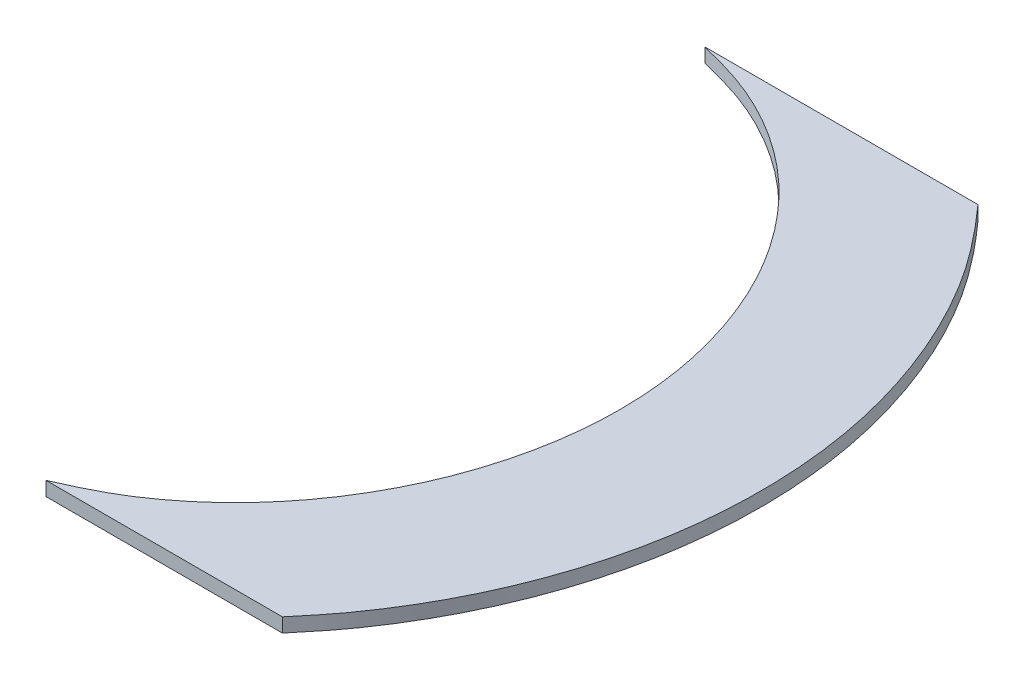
ISO-10303-21;
HEADER;
FILE_DESCRIPTION(('STEP AP214'),'2;1');
FILE_NAME('part.step','',(''),(''),'','','');
FILE_SCHEMA(('AUTOMOTIVE_DESIGN { 1 0 10303 214 1 1 1 1 }'));
ENDSEC;
DATA;
#1=APPLICATION_CONTEXT('core data for automotive mechanical design processes');
#2=APPLICATION_PROTOCOL_DEFINITION('international standard','automotive_design',2000,#1);
#3=PRODUCT_CONTEXT('',#1,'mechanical');
#4=PRODUCT('Part','Part','',(#3));
#5=PRODUCT_RELATED_PRODUCT_CATEGORY('part','',(#4));
#6=PRODUCT_DEFINITION_FORMATION('','',#4);
#7=PRODUCT_DEFINITION_CONTEXT('part definition',#1,'design');
#8=PRODUCT_DEFINITION('design','',#6,#7);
#9=PRODUCT_DEFINITION_SHAPE('','',#8);
#10=(LENGTH_UNIT() NAMED_UNIT(*) SI_UNIT(.MILLI.,.METRE.));
#11=(NAMED_UNIT(*) PLANE_ANGLE_UNIT() SI_UNIT($,.RADIAN.));
#12=(NAMED_UNIT(*) SI_UNIT($,.STERADIAN.) SOLID_ANGLE_UNIT());
#13=UNCERTAINTY_MEASURE_WITH_UNIT(LENGTH_MEASURE(1.E-05),#10,'distance_accuracy_value','');
#14=(GEOMETRIC_REPRESENTATION_CONTEXT(3) GLOBAL_UNCERTAINTY_ASSIGNED_CONTEXT((#13)) GLOBAL_UNIT_ASSIGNED_CONTEXT((#10,
#11,#12)) REPRESENTATION_CONTEXT('',''));
#15=CARTESIAN_POINT('',(0.,0.,0.));
#16=DIRECTION('',(0.,0.,1.));
#17=DIRECTION('',(1.,0.,0.));
#18=AXIS2_PLACEMENT_3D('',#15,#16,#17);
#19=CARTESIAN_POINT('',(6.52208246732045,51.2489898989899,100.));
#20=CARTESIAN_POINT('',(7.9836551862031,51.2489898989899,99.372543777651));
#21=CARTESIAN_POINT('',(9.32470354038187,51.2489898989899,98.7529372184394));
#22=CARTESIAN_POINT('',(11.1554895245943,51.2489898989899,97.8353018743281));
#23=CARTESIAN_POINT('',(11.7356204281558,51.2489898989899,97.5313858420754));
#24=CARTESIAN_POINT('',(12.5606201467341,51.2489898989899,97.0784554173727));
#25=CARTESIAN_POINT('',(12.8280872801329,51.2489898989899,96.9279692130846));
#26=CARTESIAN_POINT('',(13.21798882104,51.2489898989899,96.7029758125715));
#27=CARTESIAN_POINT('',(13.3460728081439,51.2489898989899,96.628100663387));
#28=CARTESIAN_POINT('',(13.535373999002,51.2489898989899,96.51597191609));
#29=CARTESIAN_POINT('',(13.5980035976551,51.2489898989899,96.4786263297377));
#30=CARTESIAN_POINT('',(13.6912417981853,51.2489898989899,96.4226539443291));
#31=CARTESIAN_POINT('',(13.7222034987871,51.2489898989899,96.4040041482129));
#32=CARTESIAN_POINT('',(13.7684695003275,51.2489898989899,96.3760409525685));
#33=CARTESIAN_POINT('',(13.7838620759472,51.2489898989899,96.3667218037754));
#34=CARTESIAN_POINT('',(13.8069068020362,51.2489898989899,96.3527459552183));
#35=CARTESIAN_POINT('',(13.8145810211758,51.2489898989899,96.3480878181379));
#36=CARTESIAN_POINT('',(13.829914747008,51.2489898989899,96.3387725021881));
#37=CARTESIAN_POINT('',(13.8363793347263,51.2489898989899,96.334842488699));
#38=CARTESIAN_POINT('',(14.9776512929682,51.2489898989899,95.6403238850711));
#39=CARTESIAN_POINT('',(16.0920208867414,51.2489898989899,94.8893313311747));
#40=CARTESIAN_POINT('',(17.7364923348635,51.2489898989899,93.6700557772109));
#41=CARTESIAN_POINT('',(18.2801356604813,51.2489898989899,93.2481661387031));
#42=CARTESIAN_POINT('',(19.0888299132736,51.2489898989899,92.5921350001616));
#43=CARTESIAN_POINT('',(19.3572662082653,51.2489898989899,92.3695918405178));
#44=CARTESIAN_POINT('',(19.7582279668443,51.2489898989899,92.0299779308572));
#45=CARTESIAN_POINT('',(19.8915997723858,51.2489898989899,91.9158067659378));
#46=CARTESIAN_POINT('',(20.091234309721,51.2489898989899,91.74310022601));
#47=CARTESIAN_POINT('',(20.1577086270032,51.2489898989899,91.6852897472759));
#48=CARTESIAN_POINT('',(20.2573143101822,51.2489898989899,91.5982115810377));
#49=CARTESIAN_POINT('',(20.2904985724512,51.2489898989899,91.569125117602));
#50=CARTESIAN_POINT('',(20.356831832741,51.2489898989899,91.5108313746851));
#51=CARTESIAN_POINT('',(20.3914267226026,51.2489898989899,91.48034681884));
#52=CARTESIAN_POINT('',(22.4509825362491,51.2489898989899,89.6609700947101));
#53=CARTESIAN_POINT('',(24.3282934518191,51.2489898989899,87.7133487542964));
#54=CARTESIAN_POINT('',(26.9184206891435,51.2489898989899,84.5575642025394));
#55=CARTESIAN_POINT('',(27.7441565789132,51.2489898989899,83.4665772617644));
#56=CARTESIAN_POINT('',(28.9263006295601,51.2489898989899,81.7715087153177));
#57=CARTESIAN_POINT('',(29.3109386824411,51.2489898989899,81.1967211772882));
#58=CARTESIAN_POINT('',(29.8737808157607,51.2489898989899,80.3198928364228));
#59=CARTESIAN_POINT('',(30.0590423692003,51.2489898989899,80.0251755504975));
#60=CARTESIAN_POINT('',(30.3334059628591,51.2489898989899,79.5794378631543));
#61=CARTESIAN_POINT('',(30.4242723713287,51.2489898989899,79.430248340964));
#62=CARTESIAN_POINT('',(30.5596897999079,51.2489898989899,79.2055486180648));
#63=CARTESIAN_POINT('',(30.6046819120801,51.2489898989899,79.1304961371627));
#64=CARTESIAN_POINT('',(30.6943720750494,51.2489898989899,78.9800860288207));
#65=CARTESIAN_POINT('',(30.740118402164,51.2489898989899,78.9029516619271));
#66=CARTESIAN_POINT('',(32.1757089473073,51.2489898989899,76.4697474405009));
#67=CARTESIAN_POINT('',(33.3847154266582,51.2489898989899,74.028719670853));
#68=CARTESIAN_POINT('',(34.9236031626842,51.2489898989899,70.2448425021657));
#69=CARTESIAN_POINT('',(35.3907954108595,51.2489898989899,68.9631608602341));
#70=CARTESIAN_POINT('',(36.0229282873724,51.2489898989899,67.0100545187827));
#71=CARTESIAN_POINT('',(36.222196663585,51.2489898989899,66.3539217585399));
#72=CARTESIAN_POINT('',(36.5039353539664,51.2489898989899,65.3620766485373));
#73=CARTESIAN_POINT('',(36.5949876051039,51.2489898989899,65.0301872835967));
#74=CARTESIAN_POINT('',(36.7713708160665,51.2489898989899,64.3638598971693));
#75=CARTESIAN_POINT('',(36.8563010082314,51.2489898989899,64.0310532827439));
#76=CARTESIAN_POINT('',(37.6021407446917,51.2489898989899,60.9949594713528));
#77=CARTESIAN_POINT('',(38.0598480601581,51.2489898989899,58.2900673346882));
#78=CARTESIAN_POINT('',(38.4385170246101,51.2489898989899,54.2235160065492));
#79=CARTESIAN_POINT('',(38.5134246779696,51.2489898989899,52.8664633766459));
#80=CARTESIAN_POINT('',(38.5488131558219,51.2489898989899,50.8285811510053));
#81=CARTESIAN_POINT('',(38.5477804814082,51.2489898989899,50.1489031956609));
#82=CARTESIAN_POINT('',(38.5269882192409,51.2489898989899,49.1288104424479));
#83=CARTESIAN_POINT('',(38.5168502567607,51.2489898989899,48.7886835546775));
#84=CARTESIAN_POINT('',(38.4901599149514,51.2489898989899,48.1082378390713));
#85=CARTESIAN_POINT('',(38.4736891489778,51.2489898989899,47.769325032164));
#86=CARTESIAN_POINT('',(38.295118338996,51.2489898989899,44.692937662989));
#87=CARTESIAN_POINT('',(37.9351836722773,51.2489898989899,41.9934505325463));
#88=CARTESIAN_POINT('',(37.0934740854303,51.2489898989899,37.9968389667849));
#89=CARTESIAN_POINT('',(36.7626029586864,51.2489898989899,36.6734049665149));
#90=CARTESIAN_POINT('',(36.1908443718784,51.2489898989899,34.7014087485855));
#91=CARTESIAN_POINT('',(35.9876828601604,51.2489898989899,34.0462691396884));
#92=CARTESIAN_POINT('',(35.6640776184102,51.2489898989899,33.0668484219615));
#93=CARTESIAN_POINT('',(35.5530653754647,51.2489898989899,32.7409229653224));
#94=CARTESIAN_POINT('',(35.3818312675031,51.2489898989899,32.2528569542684));
#95=CARTESIAN_POINT('',(35.3239672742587,51.2489898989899,32.0903053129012));
#96=CARTESIAN_POINT('',(35.2066673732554,51.2489898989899,31.765476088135));
#97=CARTESIAN_POINT('',(35.1477008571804,51.2489898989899,31.6044622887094));
#98=CARTESIAN_POINT('',(34.115949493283,51.2489898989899,28.8265885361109));
#99=CARTESIAN_POINT('',(32.9692765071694,51.2489898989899,26.3296184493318));
#100=CARTESIAN_POINT('',(30.985847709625,51.2489898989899,22.7604123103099));
#101=CARTESIAN_POINT('',(30.2808015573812,51.2489898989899,21.6000517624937));
#102=CARTESIAN_POINT('',(29.157377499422,51.2489898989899,19.9035731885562));
#103=CARTESIAN_POINT('',(28.7719270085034,51.2489898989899,19.3454240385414));
#104=CARTESIAN_POINT('',(28.177287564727,51.2489898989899,18.519215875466));
#105=CARTESIAN_POINT('',(27.9763304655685,51.2489898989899,18.245649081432));
#106=CARTESIAN_POINT('',(27.6707788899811,51.2489898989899,17.8380527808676));
#107=CARTESIAN_POINT('',(27.5682423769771,51.2489898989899,17.7026463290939));
#108=CARTESIAN_POINT('',(27.4134086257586,51.2489898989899,17.5002251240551));
#109=CARTESIAN_POINT('',(27.3616258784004,51.2489898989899,17.4328661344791));
#110=CARTESIAN_POINT('',(27.2836945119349,51.2489898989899,17.3319997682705));
#111=CARTESIAN_POINT('',(27.2576745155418,51.2489898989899,17.2984063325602));
#112=CARTESIAN_POINT('',(27.2055487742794,51.2489898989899,17.2312768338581));
#113=CARTESIAN_POINT('',(27.1802887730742,51.2489898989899,17.198824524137));
#114=CARTESIAN_POINT('',(25.4256551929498,51.2489898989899,14.9504010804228));
#115=CARTESIAN_POINT('',(23.5582765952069,51.2489898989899,12.9258765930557));
#116=CARTESIAN_POINT('',(20.547599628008,51.2489898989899,10.1730516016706));
#117=CARTESIAN_POINT('',(19.5091057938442,51.2489898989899,9.30277022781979));
#118=CARTESIAN_POINT('',(17.8989627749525,51.2489898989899,8.06833860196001));
#119=CARTESIAN_POINT('',(17.3535147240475,51.2489898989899,7.66869313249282));
#120=CARTESIAN_POINT('',(16.5222420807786,51.2489898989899,7.08697253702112));
#121=CARTESIAN_POINT('',(16.2429677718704,51.2489898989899,6.89602360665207));
#122=CARTESIAN_POINT('',(15.8207811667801,51.2489898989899,6.61403711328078));
#123=CARTESIAN_POINT('',(15.679506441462,51.2489898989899,6.52078109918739));
#124=CARTESIAN_POINT('',(15.466775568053,51.2489898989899,6.38200630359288));
#125=CARTESIAN_POINT('',(15.395728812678,51.2489898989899,6.33593290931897));
#126=CARTESIAN_POINT('',(15.2533623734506,51.2489898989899,6.24415586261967));
#127=CARTESIAN_POINT('',(15.1836421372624,51.2489898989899,6.19947108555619));
#128=CARTESIAN_POINT('',(13.9416970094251,51.2489898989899,5.40833091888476));
#129=CARTESIAN_POINT('',(12.7510222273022,51.2489898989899,4.72290299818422));
#130=CARTESIAN_POINT('',(10.9323321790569,51.2489898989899,3.78352300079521));
#131=CARTESIAN_POINT('',(10.3206558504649,51.2489898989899,3.48518998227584));
#132=CARTESIAN_POINT('',(9.3949718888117,51.2489898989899,3.05988092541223));
#133=CARTESIAN_POINT('',(9.08504899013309,51.2489898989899,2.92180965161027));
#134=CARTESIAN_POINT('',(8.61812227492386,51.2489898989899,2.72025035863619));
#135=CARTESIAN_POINT('',(8.4621396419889,51.2489898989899,2.65398853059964));
#136=CARTESIAN_POINT('',(8.22765510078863,51.2489898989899,2.55598269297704));
#137=CARTESIAN_POINT('',(8.14940848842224,51.2489898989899,2.52354523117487));
#138=CARTESIAN_POINT('',(8.03191092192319,51.2489898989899,2.47523576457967));
#139=CARTESIAN_POINT('',(7.99272379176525,51.2489898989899,2.45919039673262));
#140=CARTESIAN_POINT('',(7.933911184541,51.2489898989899,2.43520902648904));
#141=CARTESIAN_POINT('',(7.91430166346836,51.2489898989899,2.42722968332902));
#142=CARTESIAN_POINT('',(7.88487940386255,51.2489898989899,2.41528233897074));
#143=CARTESIAN_POINT('',(7.87507065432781,51.2489898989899,2.41130350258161));
#144=CARTESIAN_POINT('',(7.85545049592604,51.2489898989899,2.40335305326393));
#145=CARTESIAN_POINT('',(7.84403137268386,51.2489898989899,2.39873132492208));
#146=CARTESIAN_POINT('',(5.7353401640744,51.2489898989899,1.54603467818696));
#147=CARTESIAN_POINT('',(3.12339804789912,51.2489898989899,0.750896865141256));
#148=CARTESIAN_POINT('',(0.,51.2489898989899,0.00999999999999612));
#149=CARTESIAN_POINT('',(6.52208246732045,53.2489898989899,100.));
#150=CARTESIAN_POINT('',(7.9836551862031,53.2489898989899,99.372543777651));
#151=CARTESIAN_POINT('',(9.32470354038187,53.2489898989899,98.7529372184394));
#152=CARTESIAN_POINT('',(11.1554895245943,53.2489898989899,97.8353018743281));
#153=CARTESIAN_POINT('',(11.7356204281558,53.2489898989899,97.5313858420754));
#154=CARTESIAN_POINT('',(12.5606201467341,53.2489898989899,97.0784554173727));
#155=CARTESIAN_POINT('',(12.8280872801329,53.2489898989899,96.9279692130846));
#156=CARTESIAN_POINT('',(13.21798882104,53.2489898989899,96.7029758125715));
#157=CARTESIAN_POINT('',(13.3460728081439,53.2489898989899,96.628100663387));
#158=CARTESIAN_POINT('',(13.535373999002,53.2489898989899,96.51597191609));
#159=CARTESIAN_POINT('',(13.5980035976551,53.2489898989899,96.4786263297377));
#160=CARTESIAN_POINT('',(13.6912417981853,53.2489898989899,96.4226539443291));
#161=CARTESIAN_POINT('',(13.7222034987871,53.2489898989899,96.4040041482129));
#162=CARTESIAN_POINT('',(13.7684695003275,53.2489898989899,96.3760409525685));
#163=CARTESIAN_POINT('',(13.7838620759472,53.2489898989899,96.3667218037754));
#164=CARTESIAN_POINT('',(13.8069068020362,53.2489898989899,96.3527459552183));
#165=CARTESIAN_POINT('',(13.8145810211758,53.2489898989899,96.3480878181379));
#166=CARTESIAN_POINT('',(13.829914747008,53.2489898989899,96.3387725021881));
#167=CARTESIAN_POINT('',(13.8363793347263,53.2489898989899,96.334842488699));
#168=CARTESIAN_POINT('',(14.9776512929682,53.2489898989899,95.6403238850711));
#169=CARTESIAN_POINT('',(16.0920208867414,53.2489898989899,94.8893313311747));
#170=CARTESIAN_POINT('',(17.7364923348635,53.2489898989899,93.6700557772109));
#171=CARTESIAN_POINT('',(18.2801356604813,53.2489898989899,93.2481661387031));
#172=CARTESIAN_POINT('',(19.0888299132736,53.2489898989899,92.5921350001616));
#173=CARTESIAN_POINT('',(19.3572662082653,53.2489898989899,92.3695918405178));
#174=CARTESIAN_POINT('',(19.7582279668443,53.2489898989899,92.0299779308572));
#175=CARTESIAN_POINT('',(19.8915997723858,53.2489898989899,91.9158067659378));
#176=CARTESIAN_POINT('',(20.091234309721,53.2489898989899,91.74310022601));
#177=CARTESIAN_POINT('',(20.1577086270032,53.2489898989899,91.6852897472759));
#178=CARTESIAN_POINT('',(20.2573143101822,53.2489898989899,91.5982115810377));
#179=CARTESIAN_POINT('',(20.2904985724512,53.2489898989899,91.569125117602));
#180=CARTESIAN_POINT('',(20.356831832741,53.2489898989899,91.5108313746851));
#181=CARTESIAN_POINT('',(20.3914267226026,53.2489898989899,91.48034681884));
#182=CARTESIAN_POINT('',(22.4509825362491,53.2489898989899,89.6609700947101));
#183=CARTESIAN_POINT('',(24.3282934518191,53.2489898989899,87.7133487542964));
#184=CARTESIAN_POINT('',(26.9184206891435,53.2489898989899,84.5575642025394));
#185=CARTESIAN_POINT('',(27.7441565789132,53.2489898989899,83.4665772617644));
#186=CARTESIAN_POINT('',(28.9263006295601,53.2489898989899,81.7715087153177));
#187=CARTESIAN_POINT('',(29.3109386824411,53.2489898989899,81.1967211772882));
#188=CARTESIAN_POINT('',(29.8737808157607,53.2489898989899,80.3198928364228));
#189=CARTESIAN_POINT('',(30.0590423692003,53.2489898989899,80.0251755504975));
#190=CARTESIAN_POINT('',(30.3334059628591,53.2489898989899,79.5794378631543));
#191=CARTESIAN_POINT('',(30.4242723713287,53.2489898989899,79.430248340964));
#192=CARTESIAN_POINT('',(30.5596897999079,53.2489898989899,79.2055486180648));
#193=CARTESIAN_POINT('',(30.6046819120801,53.2489898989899,79.1304961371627));
#194=CARTESIAN_POINT('',(30.6943720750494,53.2489898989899,78.9800860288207));
#195=CARTESIAN_POINT('',(30.740118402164,53.2489898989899,78.9029516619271));
#196=CARTESIAN_POINT('',(32.1757089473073,53.2489898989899,76.4697474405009));
#197=CARTESIAN_POINT('',(33.3847154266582,53.2489898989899,74.028719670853));
#198=CARTESIAN_POINT('',(34.9236031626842,53.2489898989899,70.2448425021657));
#199=CARTESIAN_POINT('',(35.3907954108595,53.2489898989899,68.9631608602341));
#200=CARTESIAN_POINT('',(36.0229282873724,53.2489898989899,67.0100545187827));
#201=CARTESIAN_POINT('',(36.222196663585,53.2489898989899,66.3539217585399));
#202=CARTESIAN_POINT('',(36.5039353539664,53.2489898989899,65.3620766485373));
#203=CARTESIAN_POINT('',(36.5949876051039,53.2489898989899,65.0301872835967));
#204=CARTESIAN_POINT('',(36.7713708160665,53.2489898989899,64.3638598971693));
#205=CARTESIAN_POINT('',(36.8563010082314,53.2489898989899,64.0310532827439));
#206=CARTESIAN_POINT('',(37.6021407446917,53.2489898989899,60.9949594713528));
#207=CARTESIAN_POINT('',(38.0598480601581,53.2489898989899,58.2900673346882));
#208=CARTESIAN_POINT('',(38.4385170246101,53.2489898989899,54.2235160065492));
#209=CARTESIAN_POINT('',(38.5134246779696,53.2489898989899,52.8664633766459));
#210=CARTESIAN_POINT('',(38.5488131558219,53.2489898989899,50.8285811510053));
#211=CARTESIAN_POINT('',(38.5477804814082,53.2489898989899,50.1489031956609));
#212=CARTESIAN_POINT('',(38.5269882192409,53.2489898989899,49.1288104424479));
#213=CARTESIAN_POINT('',(38.5168502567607,53.2489898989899,48.7886835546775));
#214=CARTESIAN_POINT('',(38.4901599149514,53.2489898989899,48.1082378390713));
#215=CARTESIAN_POINT('',(38.4736891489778,53.2489898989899,47.769325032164));
#216=CARTESIAN_POINT('',(38.295118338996,53.2489898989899,44.692937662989));
#217=CARTESIAN_POINT('',(37.9351836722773,53.2489898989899,41.9934505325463));
#218=CARTESIAN_POINT('',(37.0934740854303,53.2489898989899,37.9968389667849));
#219=CARTESIAN_POINT('',(36.7626029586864,53.2489898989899,36.6734049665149));
#220=CARTESIAN_POINT('',(36.1908443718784,53.2489898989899,34.7014087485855));
#221=CARTESIAN_POINT('',(35.9876828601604,53.2489898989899,34.0462691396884));
#222=CARTESIAN_POINT('',(35.6640776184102,53.2489898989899,33.0668484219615));
#223=CARTESIAN_POINT('',(35.5530653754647,53.2489898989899,32.7409229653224));
#224=CARTESIAN_POINT('',(35.3818312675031,53.2489898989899,32.2528569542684));
#225=CARTESIAN_POINT('',(35.3239672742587,53.2489898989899,32.0903053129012));
#226=CARTESIAN_POINT('',(35.2066673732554,53.2489898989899,31.765476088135));
#227=CARTESIAN_POINT('',(35.1477008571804,53.2489898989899,31.6044622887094));
#228=CARTESIAN_POINT('',(34.115949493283,53.2489898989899,28.8265885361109));
#229=CARTESIAN_POINT('',(32.9692765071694,53.2489898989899,26.3296184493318));
#230=CARTESIAN_POINT('',(30.985847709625,53.2489898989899,22.7604123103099));
#231=CARTESIAN_POINT('',(30.2808015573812,53.2489898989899,21.6000517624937));
#232=CARTESIAN_POINT('',(29.157377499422,53.2489898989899,19.9035731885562));
#233=CARTESIAN_POINT('',(28.7719270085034,53.2489898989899,19.3454240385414));
#234=CARTESIAN_POINT('',(28.177287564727,53.2489898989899,18.519215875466));
#235=CARTESIAN_POINT('',(27.9763304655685,53.2489898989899,18.245649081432));
#236=CARTESIAN_POINT('',(27.6707788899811,53.2489898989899,17.8380527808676));
#237=CARTESIAN_POINT('',(27.5682423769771,53.2489898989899,17.7026463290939));
#238=CARTESIAN_POINT('',(27.4134086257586,53.2489898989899,17.5002251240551));
#239=CARTESIAN_POINT('',(27.3616258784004,53.2489898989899,17.4328661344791));
#240=CARTESIAN_POINT('',(27.2836945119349,53.2489898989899,17.3319997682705));
#241=CARTESIAN_POINT('',(27.2576745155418,53.2489898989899,17.2984063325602));
#242=CARTESIAN_POINT('',(27.2055487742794,53.2489898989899,17.2312768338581));
#243=CARTESIAN_POINT('',(27.1802887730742,53.2489898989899,17.198824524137));
#244=CARTESIAN_POINT('',(25.4256551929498,53.2489898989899,14.9504010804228));
#245=CARTESIAN_POINT('',(23.5582765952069,53.2489898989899,12.9258765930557));
#246=CARTESIAN_POINT('',(20.547599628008,53.2489898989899,10.1730516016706));
#247=CARTESIAN_POINT('',(19.5091057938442,53.2489898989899,9.30277022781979));
#248=CARTESIAN_POINT('',(17.8989627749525,53.2489898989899,8.06833860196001));
#249=CARTESIAN_POINT('',(17.3535147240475,53.2489898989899,7.66869313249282));
#250=CARTESIAN_POINT('',(16.5222420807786,53.2489898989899,7.08697253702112));
#251=CARTESIAN_POINT('',(16.2429677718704,53.2489898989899,6.89602360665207));
#252=CARTESIAN_POINT('',(15.8207811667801,53.2489898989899,6.61403711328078));
#253=CARTESIAN_POINT('',(15.679506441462,53.2489898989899,6.52078109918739));
#254=CARTESIAN_POINT('',(15.466775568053,53.2489898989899,6.38200630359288));
#255=CARTESIAN_POINT('',(15.395728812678,53.2489898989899,6.33593290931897));
#256=CARTESIAN_POINT('',(15.2533623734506,53.2489898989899,6.24415586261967));
#257=CARTESIAN_POINT('',(15.1836421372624,53.2489898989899,6.19947108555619));
#258=CARTESIAN_POINT('',(13.9416970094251,53.2489898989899,5.40833091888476));
#259=CARTESIAN_POINT('',(12.7510222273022,53.2489898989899,4.72290299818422));
#260=CARTESIAN_POINT('',(10.9323321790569,53.2489898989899,3.78352300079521));
#261=CARTESIAN_POINT('',(10.3206558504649,53.2489898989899,3.48518998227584));
#262=CARTESIAN_POINT('',(9.3949718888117,53.2489898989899,3.05988092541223));
#263=CARTESIAN_POINT('',(9.08504899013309,53.2489898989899,2.92180965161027));
#264=CARTESIAN_POINT('',(8.61812227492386,53.2489898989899,2.72025035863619));
#265=CARTESIAN_POINT('',(8.4621396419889,53.2489898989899,2.65398853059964));
#266=CARTESIAN_POINT('',(8.22765510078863,53.2489898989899,2.55598269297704));
#267=CARTESIAN_POINT('',(8.14940848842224,53.2489898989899,2.52354523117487));
#268=CARTESIAN_POINT('',(8.03191092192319,53.2489898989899,2.47523576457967));
#269=CARTESIAN_POINT('',(7.99272379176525,53.2489898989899,2.45919039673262));
#270=CARTESIAN_POINT('',(7.933911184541,53.2489898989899,2.43520902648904));
#271=CARTESIAN_POINT('',(7.91430166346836,53.2489898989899,2.42722968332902));
#272=CARTESIAN_POINT('',(7.88487940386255,53.2489898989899,2.41528233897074));
#273=CARTESIAN_POINT('',(7.87507065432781,53.2489898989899,2.41130350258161));
#274=CARTESIAN_POINT('',(7.85545049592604,53.2489898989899,2.40335305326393));
#275=CARTESIAN_POINT('',(7.84403137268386,53.2489898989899,2.39873132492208));
#276=CARTESIAN_POINT('',(5.7353401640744,53.2489898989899,1.54603467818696));
#277=CARTESIAN_POINT('',(3.12339804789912,53.2489898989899,0.750896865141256));
#278=CARTESIAN_POINT('',(0.,53.2489898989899,0.00999999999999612));
#279=B_SPLINE_SURFACE_WITH_KNOTS('',1,3,((#19,#20,#21,#22,#23,#24,#25,#26,#27,#28,#29,#30,#31,
#32,#33,#34,#35,#36,#37,#38,#39,#40,#41,#42,#43,#44,#45,#46,#47,#48,#49,#50,#51,#52,#53,#54,#55,
#56,#57,#58,#59,#60,#61,#62,#63,#64,#65,#66,#67,#68,#69,#70,#71,#72,#73,#74,#75,#76,#77,#78,#79,
#80,#81,#82,#83,#84,#85,#86,#87,#88,#89,#90,#91,#92,#93,#94,#95,#96,#97,#98,#99,#100,#101,#102,
#103,#104,#105,#106,#107,#108,#109,#110,#111,#112,#113,#114,#115,#116,#117,#118,#119,#120,#121,
#122,#123,#124,#125,#126,#127,#128,#129,#130,#131,#132,#133,#134,#135,#136,#137,#138,#139,#140,
#141,#142,#143,#144,#145,#146,#147,#148),(#149,#150,#151,#152,#153,#154,#155,#156,#157,#158,
#159,#160,#161,#162,#163,#164,#165,#166,#167,#168,#169,#170,#171,#172,#173,#174,#175,#176,#177,
#178,#179,#180,#181,#182,#183,#184,#185,#186,#187,#188,#189,#190,#191,#192,#193,#194,#195,#196,
#197,#198,#199,#200,#201,#202,#203,#204,#205,#206,#207,#208,#209,#210,#211,#212,#213,#214,#215,
#216,#217,#218,#219,#220,#221,#222,#223,#224,#225,#226,#227,#228,#229,#230,#231,#232,#233,#234,
#235,#236,#237,#238,#239,#240,#241,#242,#243,#244,#245,#246,#247,#248,#249,#250,#251,#252,#253,
#254,#255,#256,#257,#258,#259,#260,#261,#262,#263,#264,#265,#266,#267,#268,#269,#270,#271,#272,
#273,#274,#275,#276,#277,#278)),.UNSPECIFIED.,.F.,.F.,.F.,(2,2),(4,2,2,2,2,2,2,2,2,2,2,2,2,2,2,
2,2,2,2,2,2,2,2,2,2,2,2,2,2,2,2,2,2,2,2,2,2,2,2,2,2,2,2,2,2,2,2,2,2,2,2,2,2,2,2,2,2,2,2,2,2,2,2,
2,4),(0.,1.),(0.,0.03125,0.046875,0.0546875,0.05859375,0.060546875,0.0615234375,0.06201171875,
0.062255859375,0.0625,0.09375,0.109375,0.1171875,0.12109375,0.123046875,0.1240234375,0.125,
0.1875,0.21875,0.234375,0.2421875,0.24609375,0.248046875,0.25,0.3125,0.34375,0.359375,0.3671875,
0.375,0.4375,0.46875,0.484375,0.4921875,0.5,0.5625,0.59375,0.609375,0.6171875,0.62109375,0.625,
0.6875,0.71875,0.734375,0.7421875,0.74609375,0.748046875,0.7490234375,0.75,0.8125,0.84375,
0.859375,0.8671875,0.87109375,0.873046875,0.875,0.90625,0.921875,0.9296875,0.93359375,
0.935546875,0.9365234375,0.93701171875,0.937255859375,0.9375,1.),.UNSPECIFIED.);
#280=DIRECTION('',(0.,-1.,0.));
#281=VECTOR('',#280,1.);
#282=CARTESIAN_POINT('',(6.52208246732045,51.2489898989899,100.));
#283=LINE('',#282,#281);
#284=CARTESIAN_POINT('',(6.52208246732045,53.2489898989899,99.9999999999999));
#285=VERTEX_POINT('',#284);
#286=CARTESIAN_POINT('',(6.52208246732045,51.2489898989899,100.));
#287=VERTEX_POINT('',#286);
#288=EDGE_CURVE('E13',#285,#287,#283,.T.);
#289=CARTESIAN_POINT('',(6.52208246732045,53.2489898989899,100.));
#290=CARTESIAN_POINT('',(7.9836551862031,53.2489898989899,99.372543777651));
#291=CARTESIAN_POINT('',(9.32470354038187,53.2489898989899,98.7529372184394));
#292=CARTESIAN_POINT('',(11.1554895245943,53.2489898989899,97.8353018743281));
#293=CARTESIAN_POINT('',(11.7356204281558,53.2489898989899,97.5313858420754));
#294=CARTESIAN_POINT('',(12.5606201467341,53.2489898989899,97.0784554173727));
#295=CARTESIAN_POINT('',(12.8280872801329,53.2489898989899,96.9279692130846));
#296=CARTESIAN_POINT('',(13.21798882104,53.2489898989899,96.7029758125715));
#297=CARTESIAN_POINT('',(13.3460728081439,53.2489898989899,96.628100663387));
#298=CARTESIAN_POINT('',(13.535373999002,53.2489898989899,96.51597191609));
#299=CARTESIAN_POINT('',(13.5980035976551,53.2489898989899,96.4786263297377));
#300=CARTESIAN_POINT('',(13.6912417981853,53.2489898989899,96.4226539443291));
#301=CARTESIAN_POINT('',(13.7222034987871,53.2489898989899,96.4040041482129));
#302=CARTESIAN_POINT('',(13.7684695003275,53.2489898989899,96.3760409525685));
#303=CARTESIAN_POINT('',(13.7838620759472,53.2489898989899,96.3667218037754));
#304=CARTESIAN_POINT('',(13.8069068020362,53.2489898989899,96.3527459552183));
#305=CARTESIAN_POINT('',(13.8145810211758,53.2489898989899,96.3480878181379));
#306=CARTESIAN_POINT('',(13.829914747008,53.2489898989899,96.3387725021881));
#307=CARTESIAN_POINT('',(13.8363793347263,53.2489898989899,96.334842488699));
#308=CARTESIAN_POINT('',(14.9776512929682,53.2489898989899,95.6403238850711));
#309=CARTESIAN_POINT('',(16.0920208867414,53.2489898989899,94.8893313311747));
#310=CARTESIAN_POINT('',(17.7364923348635,53.2489898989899,93.6700557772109));
#311=CARTESIAN_POINT('',(18.2801356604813,53.2489898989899,93.2481661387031));
#312=CARTESIAN_POINT('',(19.0888299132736,53.2489898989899,92.5921350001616));
#313=CARTESIAN_POINT('',(19.3572662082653,53.2489898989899,92.3695918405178));
#314=CARTESIAN_POINT('',(19.7582279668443,53.2489898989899,92.0299779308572));
#315=CARTESIAN_POINT('',(19.8915997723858,53.2489898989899,91.9158067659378));
#316=CARTESIAN_POINT('',(20.091234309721,53.2489898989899,91.74310022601));
#317=CARTESIAN_POINT('',(20.1577086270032,53.2489898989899,91.6852897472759));
#318=CARTESIAN_POINT('',(20.2573143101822,53.2489898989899,91.5982115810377));
#319=CARTESIAN_POINT('',(20.2904985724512,53.2489898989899,91.569125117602));
#320=CARTESIAN_POINT('',(20.356831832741,53.2489898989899,91.5108313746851));
#321=CARTESIAN_POINT('',(20.3914267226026,53.2489898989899,91.48034681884));
#322=CARTESIAN_POINT('',(22.4509825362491,53.2489898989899,89.6609700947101));
#323=CARTESIAN_POINT('',(24.3282934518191,53.2489898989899,87.7133487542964));
#324=CARTESIAN_POINT('',(26.9184206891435,53.2489898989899,84.5575642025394));
#325=CARTESIAN_POINT('',(27.7441565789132,53.2489898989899,83.4665772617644));
#326=CARTESIAN_POINT('',(28.9263006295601,53.2489898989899,81.7715087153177));
#327=CARTESIAN_POINT('',(29.3109386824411,53.2489898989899,81.1967211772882));
#328=CARTESIAN_POINT('',(29.8737808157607,53.2489898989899,80.3198928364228));
#329=CARTESIAN_POINT('',(30.0590423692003,53.2489898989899,80.0251755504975));
#330=CARTESIAN_POINT('',(30.3334059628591,53.2489898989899,79.5794378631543));
#331=CARTESIAN_POINT('',(30.4242723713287,53.2489898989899,79.430248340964));
#332=CARTESIAN_POINT('',(30.5596897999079,53.2489898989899,79.2055486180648));
#333=CARTESIAN_POINT('',(30.6046819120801,53.2489898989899,79.1304961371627));
#334=CARTESIAN_POINT('',(30.6943720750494,53.2489898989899,78.9800860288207));
#335=CARTESIAN_POINT('',(30.740118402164,53.2489898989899,78.9029516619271));
#336=CARTESIAN_POINT('',(32.1757089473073,53.2489898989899,76.4697474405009));
#337=CARTESIAN_POINT('',(33.3847154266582,53.2489898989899,74.028719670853));
#338=CARTESIAN_POINT('',(34.9236031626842,53.2489898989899,70.2448425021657));
#339=CARTESIAN_POINT('',(35.3907954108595,53.2489898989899,68.9631608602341));
#340=CARTESIAN_POINT('',(36.0229282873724,53.2489898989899,67.0100545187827));
#341=CARTESIAN_POINT('',(36.222196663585,53.2489898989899,66.3539217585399));
#342=CARTESIAN_POINT('',(36.5039353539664,53.2489898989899,65.3620766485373));
#343=CARTESIAN_POINT('',(36.5949876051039,53.2489898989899,65.0301872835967));
#344=CARTESIAN_POINT('',(36.7713708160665,53.2489898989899,64.3638598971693));
#345=CARTESIAN_POINT('',(36.8563010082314,53.2489898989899,64.0310532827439));
#346=CARTESIAN_POINT('',(37.6021407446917,53.2489898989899,60.9949594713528));
#347=CARTESIAN_POINT('',(38.0598480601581,53.2489898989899,58.2900673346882));
#348=CARTESIAN_POINT('',(38.4385170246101,53.2489898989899,54.2235160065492));
#349=CARTESIAN_POINT('',(38.5134246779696,53.2489898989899,52.8664633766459));
#350=CARTESIAN_POINT('',(38.5488131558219,53.2489898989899,50.8285811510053));
#351=CARTESIAN_POINT('',(38.5477804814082,53.2489898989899,50.1489031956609));
#352=CARTESIAN_POINT('',(38.5269882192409,53.2489898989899,49.1288104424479));
#353=CARTESIAN_POINT('',(38.5168502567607,53.2489898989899,48.7886835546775));
#354=CARTESIAN_POINT('',(38.4901599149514,53.2489898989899,48.1082378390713));
#355=CARTESIAN_POINT('',(38.4736891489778,53.2489898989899,47.769325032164));
#356=CARTESIAN_POINT('',(38.295118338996,53.2489898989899,44.692937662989));
#357=CARTESIAN_POINT('',(37.9351836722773,53.2489898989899,41.9934505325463));
#358=CARTESIAN_POINT('',(37.0934740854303,53.2489898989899,37.9968389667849));
#359=CARTESIAN_POINT('',(36.7626029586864,53.2489898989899,36.6734049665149));
#360=CARTESIAN_POINT('',(36.1908443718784,53.2489898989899,34.7014087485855));
#361=CARTESIAN_POINT('',(35.9876828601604,53.2489898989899,34.0462691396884));
#362=CARTESIAN_POINT('',(35.6640776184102,53.2489898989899,33.0668484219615));
#363=CARTESIAN_POINT('',(35.5530653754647,53.2489898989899,32.7409229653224));
#364=CARTESIAN_POINT('',(35.3818312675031,53.2489898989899,32.2528569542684));
#365=CARTESIAN_POINT('',(35.3239672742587,53.2489898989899,32.0903053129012));
#366=CARTESIAN_POINT('',(35.2066673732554,53.2489898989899,31.765476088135));
#367=CARTESIAN_POINT('',(35.1477008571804,53.2489898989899,31.6044622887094));
#368=CARTESIAN_POINT('',(34.115949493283,53.2489898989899,28.8265885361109));
#369=CARTESIAN_POINT('',(32.9692765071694,53.2489898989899,26.3296184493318));
#370=CARTESIAN_POINT('',(30.985847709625,53.2489898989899,22.7604123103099));
#371=CARTESIAN_POINT('',(30.2808015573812,53.2489898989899,21.6000517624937));
#372=CARTESIAN_POINT('',(29.157377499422,53.2489898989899,19.9035731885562));
#373=CARTESIAN_POINT('',(28.7719270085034,53.2489898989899,19.3454240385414));
#374=CARTESIAN_POINT('',(28.177287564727,53.2489898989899,18.519215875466));
#375=CARTESIAN_POINT('',(27.9763304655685,53.2489898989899,18.245649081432));
#376=CARTESIAN_POINT('',(27.6707788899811,53.2489898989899,17.8380527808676));
#377=CARTESIAN_POINT('',(27.5682423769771,53.2489898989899,17.7026463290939));
#378=CARTESIAN_POINT('',(27.4134086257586,53.2489898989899,17.5002251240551));
#379=CARTESIAN_POINT('',(27.3616258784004,53.2489898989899,17.4328661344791));
#380=CARTESIAN_POINT('',(27.2836945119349,53.2489898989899,17.3319997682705));
#381=CARTESIAN_POINT('',(27.2576745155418,53.2489898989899,17.2984063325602));
#382=CARTESIAN_POINT('',(27.2055487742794,53.2489898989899,17.2312768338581));
#383=CARTESIAN_POINT('',(27.1802887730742,53.2489898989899,17.198824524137));
#384=CARTESIAN_POINT('',(25.4256551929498,53.2489898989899,14.9504010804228));
#385=CARTESIAN_POINT('',(23.5582765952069,53.2489898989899,12.9258765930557));
#386=CARTESIAN_POINT('',(20.547599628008,53.2489898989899,10.1730516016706));
#387=CARTESIAN_POINT('',(19.5091057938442,53.2489898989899,9.30277022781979));
#388=CARTESIAN_POINT('',(17.8989627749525,53.2489898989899,8.06833860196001));
#389=CARTESIAN_POINT('',(17.3535147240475,53.2489898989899,7.66869313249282));
#390=CARTESIAN_POINT('',(16.5222420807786,53.2489898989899,7.08697253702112));
#391=CARTESIAN_POINT('',(16.2429677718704,53.2489898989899,6.89602360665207));
#392=CARTESIAN_POINT('',(15.8207811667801,53.2489898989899,6.61403711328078));
#393=CARTESIAN_POINT('',(15.679506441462,53.2489898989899,6.52078109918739));
#394=CARTESIAN_POINT('',(15.466775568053,53.2489898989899,6.38200630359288));
#395=CARTESIAN_POINT('',(15.395728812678,53.2489898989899,6.33593290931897));
#396=CARTESIAN_POINT('',(15.2533623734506,53.2489898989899,6.24415586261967));
#397=CARTESIAN_POINT('',(15.1836421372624,53.2489898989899,6.19947108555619));
#398=CARTESIAN_POINT('',(13.9416970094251,53.2489898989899,5.40833091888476));
#399=CARTESIAN_POINT('',(12.7510222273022,53.2489898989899,4.72290299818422));
#400=CARTESIAN_POINT('',(10.9323321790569,53.2489898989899,3.78352300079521));
#401=CARTESIAN_POINT('',(10.3206558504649,53.2489898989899,3.48518998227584));
#402=CARTESIAN_POINT('',(9.3949718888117,53.2489898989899,3.05988092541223));
#403=CARTESIAN_POINT('',(9.08504899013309,53.2489898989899,2.92180965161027));
#404=CARTESIAN_POINT('',(8.61812227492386,53.2489898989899,2.72025035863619));
#405=CARTESIAN_POINT('',(8.4621396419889,53.2489898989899,2.65398853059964));
#406=CARTESIAN_POINT('',(8.22765510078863,53.2489898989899,2.55598269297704));
#407=CARTESIAN_POINT('',(8.14940848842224,53.2489898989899,2.52354523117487));
#408=CARTESIAN_POINT('',(8.03191092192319,53.2489898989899,2.47523576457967));
#409=CARTESIAN_POINT('',(7.99272379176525,53.2489898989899,2.45919039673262));
#410=CARTESIAN_POINT('',(7.933911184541,53.2489898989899,2.43520902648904));
#411=CARTESIAN_POINT('',(7.91430166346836,53.2489898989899,2.42722968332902));
#412=CARTESIAN_POINT('',(7.88487940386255,53.2489898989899,2.41528233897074));
#413=CARTESIAN_POINT('',(7.87507065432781,53.2489898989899,2.41130350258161));
#414=CARTESIAN_POINT('',(7.85545049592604,53.2489898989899,2.40335305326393));
#415=CARTESIAN_POINT('',(7.84403137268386,53.2489898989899,2.39873132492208));
#416=CARTESIAN_POINT('',(5.7353401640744,53.2489898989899,1.54603467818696));
#417=CARTESIAN_POINT('',(3.12339804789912,53.2489898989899,0.750896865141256));
#418=CARTESIAN_POINT('',(0.,53.2489898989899,0.00999999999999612));
#419=B_SPLINE_CURVE_WITH_KNOTS('',3,(#289,#290,#291,#292,#293,#294,#295,#296,#297,#298,#299,
#300,#301,#302,#303,#304,#305,#306,#307,#308,#309,#310,#311,#312,#313,#314,#315,#316,#317,#318,
#319,#320,#321,#322,#323,#324,#325,#326,#327,#328,#329,#330,#331,#332,#333,#334,#335,#336,#337,
#338,#339,#340,#341,#342,#343,#344,#345,#346,#347,#348,#349,#350,#351,#352,#353,#354,#355,#356,
#357,#358,#359,#360,#361,#362,#363,#364,#365,#366,#367,#368,#369,#370,#371,#372,#373,#374,#375,
#376,#377,#378,#379,#380,#381,#382,#383,#384,#385,#386,#387,#388,#389,#390,#391,#392,#393,#394,
#395,#396,#397,#398,#399,#400,#401,#402,#403,#404,#405,#406,#407,#408,#409,#410,#411,#412,#413,
#414,#415,#416,#417,#418),.UNSPECIFIED.,.F.,.F.,(4,2,2,2,2,2,2,2,2,2,2,2,2,2,2,2,2,2,2,2,2,2,2,
2,2,2,2,2,2,2,2,2,2,2,2,2,2,2,2,2,2,2,2,2,2,2,2,2,2,2,2,2,2,2,2,2,2,2,2,2,2,2,2,2,4),(0.,
0.03125,0.046875,0.0546875,0.05859375,0.060546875,0.0615234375,0.06201171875,0.062255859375,
0.0625,0.09375,0.109375,0.1171875,0.12109375,0.123046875,0.1240234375,0.125,0.1875,0.21875,
0.234375,0.2421875,0.24609375,0.248046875,0.25,0.3125,0.34375,0.359375,0.3671875,0.375,0.4375,
0.46875,0.484375,0.4921875,0.5,0.5625,0.59375,0.609375,0.6171875,0.62109375,0.625,0.6875,
0.71875,0.734375,0.7421875,0.74609375,0.748046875,0.7490234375,0.75,0.8125,0.84375,0.859375,
0.8671875,0.87109375,0.873046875,0.875,0.90625,0.921875,0.9296875,0.93359375,0.935546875,
0.9365234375,0.93701171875,0.937255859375,0.9375,1.),.UNSPECIFIED.);
#420=CARTESIAN_POINT('',(0.,53.2489898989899,0.00999999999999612));
#421=VERTEX_POINT('',#420);
#422=EDGE_CURVE('E101',#285,#421,#419,.T.);
#423=DIRECTION('',(0.,-1.,0.));
#424=VECTOR('',#423,1.);
#425=CARTESIAN_POINT('',(0.,51.2489898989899,0.00999999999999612));
#426=LINE('',#425,#424);
#427=CARTESIAN_POINT('',(0.,51.2489898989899,0.00999999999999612));
#428=VERTEX_POINT('',#427);
#429=EDGE_CURVE('E70',#421,#428,#426,.T.);
#430=CARTESIAN_POINT('',(0.,51.2489898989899,0.00999999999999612));
#431=CARTESIAN_POINT('',(3.12339804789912,51.2489898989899,0.750896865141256));
#432=CARTESIAN_POINT('',(5.7353401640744,51.2489898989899,1.54603467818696));
#433=CARTESIAN_POINT('',(7.84403137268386,51.2489898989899,2.39873132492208));
#434=CARTESIAN_POINT('',(7.85545049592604,51.2489898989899,2.40335305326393));
#435=CARTESIAN_POINT('',(7.87507065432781,51.2489898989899,2.41130350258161));
#436=CARTESIAN_POINT('',(7.88487940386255,51.2489898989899,2.41528233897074));
#437=CARTESIAN_POINT('',(7.91430166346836,51.2489898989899,2.42722968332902));
#438=CARTESIAN_POINT('',(7.933911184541,51.2489898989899,2.43520902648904));
#439=CARTESIAN_POINT('',(7.99272379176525,51.2489898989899,2.45919039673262));
#440=CARTESIAN_POINT('',(8.03191092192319,51.2489898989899,2.47523576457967));
#441=CARTESIAN_POINT('',(8.14940848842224,51.2489898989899,2.52354523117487));
#442=CARTESIAN_POINT('',(8.22765510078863,51.2489898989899,2.55598269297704));
#443=CARTESIAN_POINT('',(8.4621396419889,51.2489898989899,2.65398853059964));
#444=CARTESIAN_POINT('',(8.61812227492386,51.2489898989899,2.72025035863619));
#445=CARTESIAN_POINT('',(9.08504899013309,51.2489898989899,2.92180965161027));
#446=CARTESIAN_POINT('',(9.3949718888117,51.2489898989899,3.05988092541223));
#447=CARTESIAN_POINT('',(10.3206558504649,51.2489898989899,3.48518998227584));
#448=CARTESIAN_POINT('',(10.9323321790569,51.2489898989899,3.78352300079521));
#449=CARTESIAN_POINT('',(12.7510222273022,51.2489898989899,4.72290299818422));
#450=CARTESIAN_POINT('',(13.9416970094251,51.2489898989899,5.40833091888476));
#451=CARTESIAN_POINT('',(15.1836421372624,51.2489898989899,6.19947108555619));
#452=CARTESIAN_POINT('',(15.2533623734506,51.2489898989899,6.24415586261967));
#453=CARTESIAN_POINT('',(15.395728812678,51.2489898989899,6.33593290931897));
#454=CARTESIAN_POINT('',(15.466775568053,51.2489898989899,6.38200630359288));
#455=CARTESIAN_POINT('',(15.679506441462,51.2489898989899,6.52078109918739));
#456=CARTESIAN_POINT('',(15.8207811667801,51.2489898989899,6.61403711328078));
#457=CARTESIAN_POINT('',(16.2429677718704,51.2489898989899,6.89602360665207));
#458=CARTESIAN_POINT('',(16.5222420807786,51.2489898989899,7.08697253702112));
#459=CARTESIAN_POINT('',(17.3535147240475,51.2489898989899,7.66869313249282));
#460=CARTESIAN_POINT('',(17.8989627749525,51.2489898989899,8.06833860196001));
#461=CARTESIAN_POINT('',(19.5091057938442,51.2489898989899,9.30277022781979));
#462=CARTESIAN_POINT('',(20.547599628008,51.2489898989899,10.1730516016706));
#463=CARTESIAN_POINT('',(23.5582765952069,51.2489898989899,12.9258765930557));
#464=CARTESIAN_POINT('',(25.4256551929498,51.2489898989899,14.9504010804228));
#465=CARTESIAN_POINT('',(27.1802887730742,51.2489898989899,17.198824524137));
#466=CARTESIAN_POINT('',(27.2055487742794,51.2489898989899,17.2312768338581));
#467=CARTESIAN_POINT('',(27.2576745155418,51.2489898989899,17.2984063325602));
#468=CARTESIAN_POINT('',(27.2836945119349,51.2489898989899,17.3319997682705));
#469=CARTESIAN_POINT('',(27.3616258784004,51.2489898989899,17.4328661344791));
#470=CARTESIAN_POINT('',(27.4134086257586,51.2489898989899,17.5002251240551));
#471=CARTESIAN_POINT('',(27.5682423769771,51.2489898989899,17.7026463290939));
#472=CARTESIAN_POINT('',(27.6707788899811,51.2489898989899,17.8380527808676));
#473=CARTESIAN_POINT('',(27.9763304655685,51.2489898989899,18.245649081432));
#474=CARTESIAN_POINT('',(28.177287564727,51.2489898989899,18.519215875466));
#475=CARTESIAN_POINT('',(28.7719270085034,51.2489898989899,19.3454240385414));
#476=CARTESIAN_POINT('',(29.157377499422,51.2489898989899,19.9035731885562));
#477=CARTESIAN_POINT('',(30.2808015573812,51.2489898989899,21.6000517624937));
#478=CARTESIAN_POINT('',(30.985847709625,51.2489898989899,22.7604123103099));
#479=CARTESIAN_POINT('',(32.9692765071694,51.2489898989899,26.3296184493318));
#480=CARTESIAN_POINT('',(34.115949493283,51.2489898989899,28.8265885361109));
#481=CARTESIAN_POINT('',(35.1477008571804,51.2489898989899,31.6044622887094));
#482=CARTESIAN_POINT('',(35.2066673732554,51.2489898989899,31.765476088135));
#483=CARTESIAN_POINT('',(35.3239672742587,51.2489898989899,32.0903053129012));
#484=CARTESIAN_POINT('',(35.3818312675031,51.2489898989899,32.2528569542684));
#485=CARTESIAN_POINT('',(35.5530653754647,51.2489898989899,32.7409229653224));
#486=CARTESIAN_POINT('',(35.6640776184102,51.2489898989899,33.0668484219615));
#487=CARTESIAN_POINT('',(35.9876828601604,51.2489898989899,34.0462691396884));
#488=CARTESIAN_POINT('',(36.1908443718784,51.2489898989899,34.7014087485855));
#489=CARTESIAN_POINT('',(36.7626029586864,51.2489898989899,36.6734049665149));
#490=CARTESIAN_POINT('',(37.0934740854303,51.2489898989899,37.9968389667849));
#491=CARTESIAN_POINT('',(37.9351836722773,51.2489898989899,41.9934505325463));
#492=CARTESIAN_POINT('',(38.295118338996,51.2489898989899,44.692937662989));
#493=CARTESIAN_POINT('',(38.4736891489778,51.2489898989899,47.769325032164));
#494=CARTESIAN_POINT('',(38.4901599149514,51.2489898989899,48.1082378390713));
#495=CARTESIAN_POINT('',(38.5168502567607,51.2489898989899,48.7886835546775));
#496=CARTESIAN_POINT('',(38.5269882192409,51.2489898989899,49.1288104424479));
#497=CARTESIAN_POINT('',(38.5477804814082,51.2489898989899,50.1489031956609));
#498=CARTESIAN_POINT('',(38.5488131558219,51.2489898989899,50.8285811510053));
#499=CARTESIAN_POINT('',(38.5134246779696,51.2489898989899,52.8664633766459));
#500=CARTESIAN_POINT('',(38.4385170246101,51.2489898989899,54.2235160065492));
#501=CARTESIAN_POINT('',(38.0598480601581,51.2489898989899,58.2900673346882));
#502=CARTESIAN_POINT('',(37.6021407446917,51.2489898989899,60.9949594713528));
#503=CARTESIAN_POINT('',(36.8563010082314,51.2489898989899,64.0310532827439));
#504=CARTESIAN_POINT('',(36.7713708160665,51.2489898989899,64.3638598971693));
#505=CARTESIAN_POINT('',(36.5949876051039,51.2489898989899,65.0301872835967));
#506=CARTESIAN_POINT('',(36.5039353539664,51.2489898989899,65.3620766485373));
#507=CARTESIAN_POINT('',(36.222196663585,51.2489898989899,66.3539217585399));
#508=CARTESIAN_POINT('',(36.0229282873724,51.2489898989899,67.0100545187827));
#509=CARTESIAN_POINT('',(35.3907954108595,51.2489898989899,68.9631608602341));
#510=CARTESIAN_POINT('',(34.9236031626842,51.2489898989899,70.2448425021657));
#511=CARTESIAN_POINT('',(33.3847154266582,51.2489898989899,74.028719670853));
#512=CARTESIAN_POINT('',(32.1757089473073,51.2489898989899,76.4697474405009));
#513=CARTESIAN_POINT('',(30.740118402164,51.2489898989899,78.9029516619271));
#514=CARTESIAN_POINT('',(30.6943720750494,51.2489898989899,78.9800860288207));
#515=CARTESIAN_POINT('',(30.6046819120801,51.2489898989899,79.1304961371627));
#516=CARTESIAN_POINT('',(30.5596897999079,51.2489898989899,79.2055486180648));
#517=CARTESIAN_POINT('',(30.4242723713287,51.2489898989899,79.430248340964));
#518=CARTESIAN_POINT('',(30.3334059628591,51.2489898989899,79.5794378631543));
#519=CARTESIAN_POINT('',(30.0590423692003,51.2489898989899,80.0251755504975));
#520=CARTESIAN_POINT('',(29.8737808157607,51.2489898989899,80.3198928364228));
#521=CARTESIAN_POINT('',(29.3109386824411,51.2489898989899,81.1967211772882));
#522=CARTESIAN_POINT('',(28.9263006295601,51.2489898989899,81.7715087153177));
#523=CARTESIAN_POINT('',(27.7441565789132,51.2489898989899,83.4665772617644));
#524=CARTESIAN_POINT('',(26.9184206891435,51.2489898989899,84.5575642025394));
#525=CARTESIAN_POINT('',(24.3282934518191,51.2489898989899,87.7133487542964));
#526=CARTESIAN_POINT('',(22.4509825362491,51.2489898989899,89.6609700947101));
#527=CARTESIAN_POINT('',(20.3914267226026,51.2489898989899,91.48034681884));
#528=CARTESIAN_POINT('',(20.356831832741,51.2489898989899,91.5108313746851));
#529=CARTESIAN_POINT('',(20.2904985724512,51.2489898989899,91.569125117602));
#530=CARTESIAN_POINT('',(20.2573143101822,51.2489898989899,91.5982115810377));
#531=CARTESIAN_POINT('',(20.1577086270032,51.2489898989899,91.6852897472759));
#532=CARTESIAN_POINT('',(20.091234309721,51.2489898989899,91.74310022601));
#533=CARTESIAN_POINT('',(19.8915997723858,51.2489898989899,91.9158067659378));
#534=CARTESIAN_POINT('',(19.7582279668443,51.2489898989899,92.0299779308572));
#535=CARTESIAN_POINT('',(19.3572662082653,51.2489898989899,92.3695918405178));
#536=CARTESIAN_POINT('',(19.0888299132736,51.2489898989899,92.5921350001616));
#537=CARTESIAN_POINT('',(18.2801356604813,51.2489898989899,93.2481661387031));
#538=CARTESIAN_POINT('',(17.7364923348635,51.2489898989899,93.6700557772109));
#539=CARTESIAN_POINT('',(16.0920208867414,51.2489898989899,94.8893313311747));
#540=CARTESIAN_POINT('',(14.9776512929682,51.2489898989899,95.6403238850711));
#541=CARTESIAN_POINT('',(13.8363793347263,51.2489898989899,96.334842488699));
#542=CARTESIAN_POINT('',(13.829914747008,51.2489898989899,96.3387725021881));
#543=CARTESIAN_POINT('',(13.8145810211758,51.2489898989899,96.3480878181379));
#544=CARTESIAN_POINT('',(13.8069068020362,51.2489898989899,96.3527459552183));
#545=CARTESIAN_POINT('',(13.7838620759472,51.2489898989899,96.3667218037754));
#546=CARTESIAN_POINT('',(13.7684695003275,51.2489898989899,96.3760409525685));
#547=CARTESIAN_POINT('',(13.7222034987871,51.2489898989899,96.4040041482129));
#548=CARTESIAN_POINT('',(13.6912417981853,51.2489898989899,96.4226539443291));
#549=CARTESIAN_POINT('',(13.5980035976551,51.2489898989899,96.4786263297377));
#550=CARTESIAN_POINT('',(13.535373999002,51.2489898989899,96.51597191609));
#551=CARTESIAN_POINT('',(13.3460728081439,51.2489898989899,96.628100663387));
#552=CARTESIAN_POINT('',(13.21798882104,51.2489898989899,96.7029758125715));
#553=CARTESIAN_POINT('',(12.8280872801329,51.2489898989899,96.9279692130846));
#554=CARTESIAN_POINT('',(12.5606201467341,51.2489898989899,97.0784554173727));
#555=CARTESIAN_POINT('',(11.7356204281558,51.2489898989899,97.5313858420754));
#556=CARTESIAN_POINT('',(11.1554895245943,51.2489898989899,97.8353018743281));
#557=CARTESIAN_POINT('',(9.32470354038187,51.2489898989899,98.7529372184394));
#558=CARTESIAN_POINT('',(7.9836551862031,51.2489898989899,99.372543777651));
#559=CARTESIAN_POINT('',(6.52208246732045,51.2489898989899,100.));
#560=B_SPLINE_CURVE_WITH_KNOTS('',3,(#430,#431,#432,#433,#434,#435,#436,#437,#438,#439,#440,
#441,#442,#443,#444,#445,#446,#447,#448,#449,#450,#451,#452,#453,#454,#455,#456,#457,#458,#459,
#460,#461,#462,#463,#464,#465,#466,#467,#468,#469,#470,#471,#472,#473,#474,#475,#476,#477,#478,
#479,#480,#481,#482,#483,#484,#485,#486,#487,#488,#489,#490,#491,#492,#493,#494,#495,#496,#497,
#498,#499,#500,#501,#502,#503,#504,#505,#506,#507,#508,#509,#510,#511,#512,#513,#514,#515,#516,
#517,#518,#519,#520,#521,#522,#523,#524,#525,#526,#527,#528,#529,#530,#531,#532,#533,#534,#535,
#536,#537,#538,#539,#540,#541,#542,#543,#544,#545,#546,#547,#548,#549,#550,#551,#552,#553,#554,
#555,#556,#557,#558,#559),.UNSPECIFIED.,.F.,.F.,(4,2,2,2,2,2,2,2,2,2,2,2,2,2,2,2,2,2,2,2,2,2,2,
2,2,2,2,2,2,2,2,2,2,2,2,2,2,2,2,2,2,2,2,2,2,2,2,2,2,2,2,2,2,2,2,2,2,2,2,2,2,2,2,2,4),(0.,0.0625,
0.062744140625,0.06298828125,0.0634765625,0.064453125,0.06640625,0.0703125,0.078125,0.09375,
0.125,0.126953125,0.12890625,0.1328125,0.140625,0.15625,0.1875,0.25,0.2509765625,0.251953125,
0.25390625,0.2578125,0.265625,0.28125,0.3125,0.375,0.37890625,0.3828125,0.390625,0.40625,0.4375,
0.5,0.5078125,0.515625,0.53125,0.5625,0.625,0.6328125,0.640625,0.65625,0.6875,0.75,0.751953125,
0.75390625,0.7578125,0.765625,0.78125,0.8125,0.875,0.8759765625,0.876953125,0.87890625,
0.8828125,0.890625,0.90625,0.9375,0.937744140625,0.93798828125,0.9384765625,0.939453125,
0.94140625,0.9453125,0.953125,0.96875,1.),.UNSPECIFIED.);
#561=EDGE_CURVE('E105',#287,#428,#560,.F.);
#562=ORIENTED_EDGE('',*,*,#288,.F.);
#563=ORIENTED_EDGE('',*,*,#422,.T.);
#564=ORIENTED_EDGE('',*,*,#429,.T.);
#565=ORIENTED_EDGE('',*,*,#561,.F.);
#566=EDGE_LOOP('',(#562,#563,#564,#565));
#567=FACE_BOUND('',#566,.T.);
#568=ADVANCED_FACE('F60',(#567),#279,.T.);
#569=CARTESIAN_POINT('',(0.,51.2489898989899,0.00999999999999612));
#570=DIRECTION('',(-1.,0.,0.));
#571=DIRECTION('',(0.,0.,-1.));
#572=AXIS2_PLACEMENT_3D('',#569,#570,#571);
#573=PLANE('',#572);
#574=ORIENTED_EDGE('',*,*,#429,.F.);
#575=DIRECTION('',(0.,0.,1.));
#576=VECTOR('',#575,1.);
#577=CARTESIAN_POINT('',(0.,53.2489898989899,0.00500000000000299));
#578=LINE('',#577,#576);
#579=CARTESIAN_POINT('',(0.,53.2489898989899,0.));
#580=VERTEX_POINT('',#579);
#581=EDGE_CURVE('E120',#421,#580,#578,.F.);
#582=ORIENTED_EDGE('',*,*,#581,.T.);
#583=DIRECTION('',(0.,-1.,0.));
#584=VECTOR('',#583,1.);
#585=CARTESIAN_POINT('',(0.,51.2489898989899,0.));
#586=LINE('',#585,#584);
#587=CARTESIAN_POINT('',(0.,51.2489898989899,0.));
#588=VERTEX_POINT('',#587);
#589=EDGE_CURVE('E219',#580,#588,#586,.T.);
#590=ORIENTED_EDGE('',*,*,#589,.T.);
#591=DIRECTION('',(0.,0.,-1.));
#592=VECTOR('',#591,1.);
#593=CARTESIAN_POINT('',(0.,51.2489898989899,0.00999999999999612));
#594=LINE('',#593,#592);
#595=EDGE_CURVE('E125',#428,#588,#594,.T.);
#596=ORIENTED_EDGE('',*,*,#595,.F.);
#597=EDGE_LOOP('',(#574,#582,#590,#596));
#598=FACE_BOUND('',#597,.T.);
#599=ADVANCED_FACE('F221',(#598),#573,.T.);
#600=CARTESIAN_POINT('',(0.,51.2489898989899,0.));
#601=DIRECTION('',(0.,0.,-1.));
#602=DIRECTION('',(1.,0.,0.));
#603=AXIS2_PLACEMENT_3D('',#600,#601,#602);
#604=PLANE('',#603);
#605=ORIENTED_EDGE('',*,*,#589,.F.);
#606=DIRECTION('',(1.,0.,0.));
#607=VECTOR('',#606,1.);
#608=CARTESIAN_POINT('',(41.0362607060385,53.2489898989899,0.));
#609=LINE('',#608,#607);
#610=CARTESIAN_POINT('',(38.7581249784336,53.2489898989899,0.));
#611=VERTEX_POINT('',#610);
#612=EDGE_CURVE('E126',#580,#611,#609,.T.);
#613=ORIENTED_EDGE('',*,*,#612,.T.);
#614=DIRECTION('',(0.,-1.,0.));
#615=VECTOR('',#614,1.);
#616=CARTESIAN_POINT('',(38.7581249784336,51.2489898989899,0.));
#617=LINE('',#616,#615);
#618=CARTESIAN_POINT('',(38.7581249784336,51.2489898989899,0.));
#619=VERTEX_POINT('',#618);
#620=EDGE_CURVE('E217',#611,#619,#617,.T.);
#621=ORIENTED_EDGE('',*,*,#620,.T.);
#622=DIRECTION('',(1.,0.,0.));
#623=VECTOR('',#622,1.);
#624=CARTESIAN_POINT('',(0.,51.2489898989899,0.));
#625=LINE('',#624,#623);
#626=EDGE_CURVE('E198',#588,#619,#625,.T.);
#627=ORIENTED_EDGE('',*,*,#626,.F.);
#628=EDGE_LOOP('',(#605,#613,#621,#627));
#629=FACE_BOUND('',#628,.T.);
#630=ADVANCED_FACE('F152',(#629),#604,.T.);
#631=CARTESIAN_POINT('',(38.7581249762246,51.2489898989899,2.07459099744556E-09));
#632=CARTESIAN_POINT('',(40.4664754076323,51.2489898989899,1.90299237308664));
#633=CARTESIAN_POINT('',(42.0163183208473,51.2489898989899,3.75651612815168));
#634=CARTESIAN_POINT('',(44.1033214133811,51.2489898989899,6.46259883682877));
#635=CARTESIAN_POINT('',(44.7593622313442,51.2489898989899,7.35225925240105));
#636=CARTESIAN_POINT('',(45.6839831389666,51.2489898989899,8.66819914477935));
#637=CARTESIAN_POINT('',(45.9822833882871,51.2489898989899,9.10375398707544));
#638=CARTESIAN_POINT('',(46.4148736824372,51.2489898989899,9.75244856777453));
#639=CARTESIAN_POINT('',(46.5565937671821,51.2489898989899,9.96790714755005));
#640=CARTESIAN_POINT('',(46.7654588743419,51.2489898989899,10.2899355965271));
#641=CARTESIAN_POINT('',(46.8344614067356,51.2489898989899,10.3970851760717));
#642=CARTESIAN_POINT('',(46.9370364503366,51.2489898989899,10.5575196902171));
#643=CARTESIAN_POINT('',(46.9710733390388,51.2489898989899,10.6109495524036));
#644=CARTESIAN_POINT('',(47.0218964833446,51.2489898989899,10.6910218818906));
#645=CARTESIAN_POINT('',(47.038798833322,51.2489898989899,10.7177005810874));
#646=CARTESIAN_POINT('',(47.0640943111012,51.2489898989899,10.7577005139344));
#647=CARTESIAN_POINT('',(47.0725164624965,51.2489898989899,10.7710308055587));
#648=CARTESIAN_POINT('',(47.0893414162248,51.2489898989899,10.7976853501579));
#649=CARTESIAN_POINT('',(47.0967151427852,51.2489898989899,10.8093762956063));
#650=CARTESIAN_POINT('',(48.3121794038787,51.2489898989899,12.7385121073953));
#651=CARTESIAN_POINT('',(49.4294155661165,51.2489898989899,14.7119055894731));
#652=CARTESIAN_POINT('',(50.9720609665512,51.2489898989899,17.7608141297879));
#653=CARTESIAN_POINT('',(51.4640746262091,51.2489898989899,18.7919200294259));
#654=CARTESIAN_POINT('',(52.4036989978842,51.2489898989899,20.8837379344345));
#655=CARTESIAN_POINT('',(52.8506104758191,51.2489898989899,21.9426821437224));
#656=CARTESIAN_POINT('',(54.9811528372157,51.2489898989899,27.3290964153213));
#657=CARTESIAN_POINT('',(56.2718674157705,51.2489898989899,31.7092400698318));
#658=CARTESIAN_POINT('',(57.587360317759,51.2489898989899,38.3859739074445));
#659=CARTESIAN_POINT('',(57.9224281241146,51.2489898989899,40.6293049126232));
#660=CARTESIAN_POINT('',(58.269885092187,51.2489898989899,44.0209310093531));
#661=CARTESIAN_POINT('',(58.3598466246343,51.2489898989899,45.1559113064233));
#662=CARTESIAN_POINT('',(58.4560027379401,51.2489898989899,46.8650391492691));
#663=CARTESIAN_POINT('',(58.4815904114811,51.2489898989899,47.4358579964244));
#664=CARTESIAN_POINT('',(58.5198370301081,51.2489898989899,48.5797148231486));
#665=CARTESIAN_POINT('',(58.5325100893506,51.2489898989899,49.1540609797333));
#666=CARTESIAN_POINT('',(58.5881342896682,51.2489898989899,54.3096152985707));
#667=CARTESIAN_POINT('',(58.2258121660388,51.2489898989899,58.8363378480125));
#668=CARTESIAN_POINT('',(57.0646801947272,51.2489898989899,65.5424330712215));
#669=CARTESIAN_POINT('',(56.5746947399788,51.2489898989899,67.7638000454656));
#670=CARTESIAN_POINT('',(55.6853043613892,51.2489898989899,71.0748533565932));
#671=CARTESIAN_POINT('',(55.3631055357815,51.2489898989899,72.175038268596));
#672=CARTESIAN_POINT('',(54.8412042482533,51.2489898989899,73.8200663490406));
#673=CARTESIAN_POINT('',(54.6608033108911,51.2489898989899,74.3675341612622));
#674=CARTESIAN_POINT('',(54.3805511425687,51.2489898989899,75.1874235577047));
#675=CARTESIAN_POINT('',(54.285525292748,51.2489898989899,75.4605013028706));
#676=CARTESIAN_POINT('',(54.1405738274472,51.2489898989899,75.8697898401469));
#677=CARTESIAN_POINT('',(54.0918545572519,51.2489898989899,76.0061646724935));
#678=CARTESIAN_POINT('',(53.9936117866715,51.2489898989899,76.2788049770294));
#679=CARTESIAN_POINT('',(53.9435330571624,51.2489898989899,76.4165852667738));
#680=CARTESIAN_POINT('',(53.104236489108,51.2489898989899,78.7064168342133));
#681=CARTESIAN_POINT('',(52.2228428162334,51.2489898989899,80.81395232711));
#682=CARTESIAN_POINT('',(50.7635510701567,51.2489898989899,83.9038554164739));
#683=CARTESIAN_POINT('',(50.2542536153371,51.2489898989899,84.9219230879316));
#684=CARTESIAN_POINT('',(49.4560071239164,51.2489898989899,86.4311745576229));
#685=CARTESIAN_POINT('',(49.184208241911,51.2489898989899,86.9312833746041));
#686=CARTESIAN_POINT('',(48.7679348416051,51.2489898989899,87.6769840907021));
#687=CARTESIAN_POINT('',(48.6277478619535,51.2489898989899,87.9248072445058));
#688=CARTESIAN_POINT('',(48.4153236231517,51.2489898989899,88.2954263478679));
#689=CARTESIAN_POINT('',(48.3441582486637,51.2489898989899,88.418780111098));
#690=CARTESIAN_POINT('',(48.2368742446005,51.2489898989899,88.6035318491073));
#691=CARTESIAN_POINT('',(48.2010235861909,51.2489898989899,88.6650692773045));
#692=CARTESIAN_POINT('',(48.1291436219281,51.2489898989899,88.7880511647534));
#693=CARTESIAN_POINT('',(48.0941165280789,51.2489898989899,88.8477919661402));
#694=CARTESIAN_POINT('',(47.4630622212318,51.2489898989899,89.9205197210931));
#695=CARTESIAN_POINT('',(46.8551738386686,51.2489898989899,90.9031863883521));
#696=CARTESIAN_POINT('',(45.9224088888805,51.2489898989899,92.336747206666));
#697=CARTESIAN_POINT('',(45.6079985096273,51.2489898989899,92.8078609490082));
#698=CARTESIAN_POINT('',(45.1311498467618,51.2489898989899,93.5044217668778));
#699=CARTESIAN_POINT('',(44.9713281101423,51.2489898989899,93.7349237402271));
#700=CARTESIAN_POINT('',(44.7302872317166,51.2489898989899,94.0781492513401));
#701=CARTESIAN_POINT('',(44.6497222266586,51.2489898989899,94.1921365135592));
#702=CARTESIAN_POINT('',(44.5285476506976,51.2489898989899,94.3624855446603));
#703=CARTESIAN_POINT('',(44.4881016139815,51.2489898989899,94.419163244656));
#704=CARTESIAN_POINT('',(44.4273507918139,51.2489898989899,94.5040218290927));
#705=CARTESIAN_POINT('',(44.4070868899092,51.2489898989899,94.5322816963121));
#706=CARTESIAN_POINT('',(44.3766705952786,51.2489898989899,94.5746320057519));
#707=CARTESIAN_POINT('',(44.3665284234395,51.2489898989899,94.588742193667));
#708=CARTESIAN_POINT('',(44.3513100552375,51.2489898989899,94.6098976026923));
#709=CARTESIAN_POINT('',(44.3462364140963,51.2489898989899,94.6169477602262));
#710=CARTESIAN_POINT('',(44.3360874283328,51.2489898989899,94.6310447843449));
#711=CARTESIAN_POINT('',(44.329776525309,51.2489898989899,94.6398064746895));
#712=CARTESIAN_POINT('',(43.3427325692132,51.2489898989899,96.0097185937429));
#713=CARTESIAN_POINT('',(41.9232401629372,51.2489898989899,97.7946729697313));
#714=CARTESIAN_POINT('',(40.0674586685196,51.2489898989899,100.000000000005));
#715=CARTESIAN_POINT('',(38.7581249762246,53.2489898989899,2.07459099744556E-09));
#716=CARTESIAN_POINT('',(40.4664754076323,53.2489898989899,1.90299237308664));
#717=CARTESIAN_POINT('',(42.0163183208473,53.2489898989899,3.75651612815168));
#718=CARTESIAN_POINT('',(44.1033214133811,53.2489898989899,6.46259883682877));
#719=CARTESIAN_POINT('',(44.7593622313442,53.2489898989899,7.35225925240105));
#720=CARTESIAN_POINT('',(45.6839831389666,53.2489898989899,8.66819914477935));
#721=CARTESIAN_POINT('',(45.9822833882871,53.2489898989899,9.10375398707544));
#722=CARTESIAN_POINT('',(46.4148736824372,53.2489898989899,9.75244856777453));
#723=CARTESIAN_POINT('',(46.5565937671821,53.2489898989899,9.96790714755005));
#724=CARTESIAN_POINT('',(46.7654588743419,53.2489898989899,10.2899355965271));
#725=CARTESIAN_POINT('',(46.8344614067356,53.2489898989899,10.3970851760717));
#726=CARTESIAN_POINT('',(46.9370364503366,53.2489898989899,10.5575196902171));
#727=CARTESIAN_POINT('',(46.9710733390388,53.2489898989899,10.6109495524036));
#728=CARTESIAN_POINT('',(47.0218964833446,53.2489898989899,10.6910218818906));
#729=CARTESIAN_POINT('',(47.038798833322,53.2489898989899,10.7177005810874));
#730=CARTESIAN_POINT('',(47.0640943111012,53.2489898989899,10.7577005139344));
#731=CARTESIAN_POINT('',(47.0725164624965,53.2489898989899,10.7710308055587));
#732=CARTESIAN_POINT('',(47.0893414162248,53.2489898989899,10.7976853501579));
#733=CARTESIAN_POINT('',(47.0967151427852,53.2489898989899,10.8093762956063));
#734=CARTESIAN_POINT('',(48.3121794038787,53.2489898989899,12.7385121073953));
#735=CARTESIAN_POINT('',(49.4294155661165,53.2489898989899,14.7119055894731));
#736=CARTESIAN_POINT('',(50.9720609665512,53.2489898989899,17.7608141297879));
#737=CARTESIAN_POINT('',(51.4640746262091,53.2489898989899,18.7919200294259));
#738=CARTESIAN_POINT('',(52.4036989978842,53.2489898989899,20.8837379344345));
#739=CARTESIAN_POINT('',(52.8506104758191,53.2489898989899,21.9426821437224));
#740=CARTESIAN_POINT('',(54.9811528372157,53.2489898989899,27.3290964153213));
#741=CARTESIAN_POINT('',(56.2718674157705,53.2489898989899,31.7092400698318));
#742=CARTESIAN_POINT('',(57.587360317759,53.2489898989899,38.3859739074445));
#743=CARTESIAN_POINT('',(57.9224281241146,53.2489898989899,40.6293049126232));
#744=CARTESIAN_POINT('',(58.269885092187,53.2489898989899,44.0209310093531));
#745=CARTESIAN_POINT('',(58.3598466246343,53.2489898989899,45.1559113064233));
#746=CARTESIAN_POINT('',(58.4560027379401,53.2489898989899,46.8650391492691));
#747=CARTESIAN_POINT('',(58.4815904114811,53.2489898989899,47.4358579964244));
#748=CARTESIAN_POINT('',(58.5198370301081,53.2489898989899,48.5797148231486));
#749=CARTESIAN_POINT('',(58.5325100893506,53.2489898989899,49.1540609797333));
#750=CARTESIAN_POINT('',(58.5881342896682,53.2489898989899,54.3096152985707));
#751=CARTESIAN_POINT('',(58.2258121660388,53.2489898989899,58.8363378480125));
#752=CARTESIAN_POINT('',(57.0646801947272,53.2489898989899,65.5424330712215));
#753=CARTESIAN_POINT('',(56.5746947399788,53.2489898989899,67.7638000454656));
#754=CARTESIAN_POINT('',(55.6853043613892,53.2489898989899,71.0748533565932));
#755=CARTESIAN_POINT('',(55.3631055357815,53.2489898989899,72.175038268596));
#756=CARTESIAN_POINT('',(54.8412042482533,53.2489898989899,73.8200663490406));
#757=CARTESIAN_POINT('',(54.6608033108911,53.2489898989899,74.3675341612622));
#758=CARTESIAN_POINT('',(54.3805511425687,53.2489898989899,75.1874235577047));
#759=CARTESIAN_POINT('',(54.285525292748,53.2489898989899,75.4605013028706));
#760=CARTESIAN_POINT('',(54.1405738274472,53.2489898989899,75.8697898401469));
#761=CARTESIAN_POINT('',(54.0918545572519,53.2489898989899,76.0061646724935));
#762=CARTESIAN_POINT('',(53.9936117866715,53.2489898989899,76.2788049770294));
#763=CARTESIAN_POINT('',(53.9435330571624,53.2489898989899,76.4165852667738));
#764=CARTESIAN_POINT('',(53.104236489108,53.2489898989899,78.7064168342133));
#765=CARTESIAN_POINT('',(52.2228428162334,53.2489898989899,80.81395232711));
#766=CARTESIAN_POINT('',(50.7635510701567,53.2489898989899,83.9038554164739));
#767=CARTESIAN_POINT('',(50.2542536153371,53.2489898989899,84.9219230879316));
#768=CARTESIAN_POINT('',(49.4560071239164,53.2489898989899,86.4311745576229));
#769=CARTESIAN_POINT('',(49.184208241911,53.2489898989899,86.9312833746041));
#770=CARTESIAN_POINT('',(48.7679348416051,53.2489898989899,87.6769840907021));
#771=CARTESIAN_POINT('',(48.6277478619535,53.2489898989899,87.9248072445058));
#772=CARTESIAN_POINT('',(48.4153236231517,53.2489898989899,88.2954263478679));
#773=CARTESIAN_POINT('',(48.3441582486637,53.2489898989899,88.418780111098));
#774=CARTESIAN_POINT('',(48.2368742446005,53.2489898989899,88.6035318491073));
#775=CARTESIAN_POINT('',(48.2010235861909,53.2489898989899,88.6650692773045));
#776=CARTESIAN_POINT('',(48.1291436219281,53.2489898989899,88.7880511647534));
#777=CARTESIAN_POINT('',(48.0941165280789,53.2489898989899,88.8477919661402));
#778=CARTESIAN_POINT('',(47.4630622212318,53.2489898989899,89.9205197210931));
#779=CARTESIAN_POINT('',(46.8551738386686,53.2489898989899,90.9031863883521));
#780=CARTESIAN_POINT('',(45.9224088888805,53.2489898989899,92.336747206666));
#781=CARTESIAN_POINT('',(45.6079985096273,53.2489898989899,92.8078609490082));
#782=CARTESIAN_POINT('',(45.1311498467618,53.2489898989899,93.5044217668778));
#783=CARTESIAN_POINT('',(44.9713281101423,53.2489898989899,93.7349237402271));
#784=CARTESIAN_POINT('',(44.7302872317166,53.2489898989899,94.0781492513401));
#785=CARTESIAN_POINT('',(44.6497222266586,53.2489898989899,94.1921365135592));
#786=CARTESIAN_POINT('',(44.5285476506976,53.2489898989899,94.3624855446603));
#787=CARTESIAN_POINT('',(44.4881016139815,53.2489898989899,94.419163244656));
#788=CARTESIAN_POINT('',(44.4273507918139,53.2489898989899,94.5040218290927));
#789=CARTESIAN_POINT('',(44.4070868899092,53.2489898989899,94.5322816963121));
#790=CARTESIAN_POINT('',(44.3766705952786,53.2489898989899,94.5746320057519));
#791=CARTESIAN_POINT('',(44.3665284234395,53.2489898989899,94.588742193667));
#792=CARTESIAN_POINT('',(44.3513100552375,53.2489898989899,94.6098976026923));
#793=CARTESIAN_POINT('',(44.3462364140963,53.2489898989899,94.6169477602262));
#794=CARTESIAN_POINT('',(44.3360874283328,53.2489898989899,94.6310447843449));
#795=CARTESIAN_POINT('',(44.329776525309,53.2489898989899,94.6398064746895));
#796=CARTESIAN_POINT('',(43.3427325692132,53.2489898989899,96.0097185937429));
#797=CARTESIAN_POINT('',(41.9232401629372,53.2489898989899,97.7946729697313));
#798=CARTESIAN_POINT('',(40.0674586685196,53.2489898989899,100.000000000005));
#799=B_SPLINE_SURFACE_WITH_KNOTS('',1,3,((#631,#632,#633,#634,#635,#636,#637,#638,#639,#640,
#641,#642,#643,#644,#645,#646,#647,#648,#649,#650,#651,#652,#653,#654,#655,#656,#657,#658,#659,
#660,#661,#662,#663,#664,#665,#666,#667,#668,#669,#670,#671,#672,#673,#674,#675,#676,#677,#678,
#679,#680,#681,#682,#683,#684,#685,#686,#687,#688,#689,#690,#691,#692,#693,#694,#695,#696,#697,
#698,#699,#700,#701,#702,#703,#704,#705,#706,#707,#708,#709,#710,#711,#712,#713,#714),(#715,
#716,#717,#718,#719,#720,#721,#722,#723,#724,#725,#726,#727,#728,#729,#730,#731,#732,#733,#734,
#735,#736,#737,#738,#739,#740,#741,#742,#743,#744,#745,#746,#747,#748,#749,#750,#751,#752,#753,
#754,#755,#756,#757,#758,#759,#760,#761,#762,#763,#764,#765,#766,#767,#768,#769,#770,#771,#772,
#773,#774,#775,#776,#777,#778,#779,#780,#781,#782,#783,#784,#785,#786,#787,#788,#789,#790,#791,
#792,#793,#794,#795,#796,#797,#798)),.UNSPECIFIED.,.F.,.F.,.F.,(2,2),(4,2,2,2,2,2,2,2,2,2,2,2,2,
2,2,2,2,2,2,2,2,2,2,2,2,2,2,2,2,2,2,2,2,2,2,2,2,2,2,2,2,4),(0.,1.),(0.,0.0625,0.09375,0.109375,
0.1171875,0.12109375,0.123046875,0.1240234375,0.12451171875,0.125,0.1875,0.21875,0.25,0.375,
0.4375,0.46875,0.484375,0.5,0.625,0.6875,0.71875,0.734375,0.7421875,0.74609375,0.75,0.8125,
0.84375,0.859375,0.8671875,0.87109375,0.873046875,0.875,0.90625,0.921875,0.9296875,0.93359375,
0.935546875,0.9365234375,0.93701171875,0.937255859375,0.9375,1.),.UNSPECIFIED.);
#800=CARTESIAN_POINT('',(38.7581249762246,53.2489898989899,2.07459099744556E-09));
#801=CARTESIAN_POINT('',(40.4664754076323,53.2489898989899,1.90299237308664));
#802=CARTESIAN_POINT('',(42.0163183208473,53.2489898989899,3.75651612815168));
#803=CARTESIAN_POINT('',(44.1033214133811,53.2489898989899,6.46259883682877));
#804=CARTESIAN_POINT('',(44.7593622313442,53.2489898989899,7.35225925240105));
#805=CARTESIAN_POINT('',(45.6839831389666,53.2489898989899,8.66819914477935));
#806=CARTESIAN_POINT('',(45.9822833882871,53.2489898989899,9.10375398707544));
#807=CARTESIAN_POINT('',(46.4148736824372,53.2489898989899,9.75244856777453));
#808=CARTESIAN_POINT('',(46.5565937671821,53.2489898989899,9.96790714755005));
#809=CARTESIAN_POINT('',(46.7654588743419,53.2489898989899,10.2899355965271));
#810=CARTESIAN_POINT('',(46.8344614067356,53.2489898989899,10.3970851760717));
#811=CARTESIAN_POINT('',(46.9370364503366,53.2489898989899,10.5575196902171));
#812=CARTESIAN_POINT('',(46.9710733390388,53.2489898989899,10.6109495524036));
#813=CARTESIAN_POINT('',(47.0218964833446,53.2489898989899,10.6910218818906));
#814=CARTESIAN_POINT('',(47.038798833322,53.2489898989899,10.7177005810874));
#815=CARTESIAN_POINT('',(47.0640943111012,53.2489898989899,10.7577005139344));
#816=CARTESIAN_POINT('',(47.0725164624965,53.2489898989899,10.7710308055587));
#817=CARTESIAN_POINT('',(47.0893414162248,53.2489898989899,10.7976853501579));
#818=CARTESIAN_POINT('',(47.0967151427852,53.2489898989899,10.8093762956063));
#819=CARTESIAN_POINT('',(48.3121794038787,53.2489898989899,12.7385121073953));
#820=CARTESIAN_POINT('',(49.4294155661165,53.2489898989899,14.7119055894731));
#821=CARTESIAN_POINT('',(50.9720609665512,53.2489898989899,17.7608141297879));
#822=CARTESIAN_POINT('',(51.4640746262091,53.2489898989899,18.7919200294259));
#823=CARTESIAN_POINT('',(52.4036989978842,53.2489898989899,20.8837379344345));
#824=CARTESIAN_POINT('',(52.8506104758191,53.2489898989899,21.9426821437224));
#825=CARTESIAN_POINT('',(54.9811528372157,53.2489898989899,27.3290964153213));
#826=CARTESIAN_POINT('',(56.2718674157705,53.2489898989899,31.7092400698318));
#827=CARTESIAN_POINT('',(57.587360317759,53.2489898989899,38.3859739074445));
#828=CARTESIAN_POINT('',(57.9224281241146,53.2489898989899,40.6293049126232));
#829=CARTESIAN_POINT('',(58.269885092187,53.2489898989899,44.0209310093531));
#830=CARTESIAN_POINT('',(58.3598466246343,53.2489898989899,45.1559113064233));
#831=CARTESIAN_POINT('',(58.4560027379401,53.2489898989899,46.8650391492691));
#832=CARTESIAN_POINT('',(58.4815904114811,53.2489898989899,47.4358579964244));
#833=CARTESIAN_POINT('',(58.5198370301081,53.2489898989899,48.5797148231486));
#834=CARTESIAN_POINT('',(58.5325100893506,53.2489898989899,49.1540609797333));
#835=CARTESIAN_POINT('',(58.5881342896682,53.2489898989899,54.3096152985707));
#836=CARTESIAN_POINT('',(58.2258121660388,53.2489898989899,58.8363378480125));
#837=CARTESIAN_POINT('',(57.0646801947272,53.2489898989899,65.5424330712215));
#838=CARTESIAN_POINT('',(56.5746947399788,53.2489898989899,67.7638000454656));
#839=CARTESIAN_POINT('',(55.6853043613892,53.2489898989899,71.0748533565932));
#840=CARTESIAN_POINT('',(55.3631055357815,53.2489898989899,72.175038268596));
#841=CARTESIAN_POINT('',(54.8412042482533,53.2489898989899,73.8200663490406));
#842=CARTESIAN_POINT('',(54.6608033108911,53.2489898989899,74.3675341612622));
#843=CARTESIAN_POINT('',(54.3805511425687,53.2489898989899,75.1874235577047));
#844=CARTESIAN_POINT('',(54.285525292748,53.2489898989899,75.4605013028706));
#845=CARTESIAN_POINT('',(54.1405738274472,53.2489898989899,75.8697898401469));
#846=CARTESIAN_POINT('',(54.0918545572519,53.2489898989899,76.0061646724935));
#847=CARTESIAN_POINT('',(53.9936117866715,53.2489898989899,76.2788049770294));
#848=CARTESIAN_POINT('',(53.9435330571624,53.2489898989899,76.4165852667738));
#849=CARTESIAN_POINT('',(53.104236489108,53.2489898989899,78.7064168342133));
#850=CARTESIAN_POINT('',(52.2228428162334,53.2489898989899,80.81395232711));
#851=CARTESIAN_POINT('',(50.7635510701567,53.2489898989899,83.9038554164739));
#852=CARTESIAN_POINT('',(50.2542536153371,53.2489898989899,84.9219230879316));
#853=CARTESIAN_POINT('',(49.4560071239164,53.2489898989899,86.4311745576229));
#854=CARTESIAN_POINT('',(49.184208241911,53.2489898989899,86.9312833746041));
#855=CARTESIAN_POINT('',(48.7679348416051,53.2489898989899,87.6769840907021));
#856=CARTESIAN_POINT('',(48.6277478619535,53.2489898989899,87.9248072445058));
#857=CARTESIAN_POINT('',(48.4153236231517,53.2489898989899,88.2954263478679));
#858=CARTESIAN_POINT('',(48.3441582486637,53.2489898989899,88.418780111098));
#859=CARTESIAN_POINT('',(48.2368742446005,53.2489898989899,88.6035318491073));
#860=CARTESIAN_POINT('',(48.2010235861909,53.2489898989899,88.6650692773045));
#861=CARTESIAN_POINT('',(48.1291436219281,53.2489898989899,88.7880511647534));
#862=CARTESIAN_POINT('',(48.0941165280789,53.2489898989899,88.8477919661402));
#863=CARTESIAN_POINT('',(47.4630622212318,53.2489898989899,89.9205197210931));
#864=CARTESIAN_POINT('',(46.8551738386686,53.2489898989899,90.9031863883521));
#865=CARTESIAN_POINT('',(45.9224088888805,53.2489898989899,92.336747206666));
#866=CARTESIAN_POINT('',(45.6079985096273,53.2489898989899,92.8078609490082));
#867=CARTESIAN_POINT('',(45.1311498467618,53.2489898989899,93.5044217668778));
#868=CARTESIAN_POINT('',(44.9713281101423,53.2489898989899,93.7349237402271));
#869=CARTESIAN_POINT('',(44.7302872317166,53.2489898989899,94.0781492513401));
#870=CARTESIAN_POINT('',(44.6497222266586,53.2489898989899,94.1921365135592));
#871=CARTESIAN_POINT('',(44.5285476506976,53.2489898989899,94.3624855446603));
#872=CARTESIAN_POINT('',(44.4881016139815,53.2489898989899,94.419163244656));
#873=CARTESIAN_POINT('',(44.4273507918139,53.2489898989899,94.5040218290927));
#874=CARTESIAN_POINT('',(44.4070868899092,53.2489898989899,94.5322816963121));
#875=CARTESIAN_POINT('',(44.3766705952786,53.2489898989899,94.5746320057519));
#876=CARTESIAN_POINT('',(44.3665284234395,53.2489898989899,94.588742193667));
#877=CARTESIAN_POINT('',(44.3513100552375,53.2489898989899,94.6098976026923));
#878=CARTESIAN_POINT('',(44.3462364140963,53.2489898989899,94.6169477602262));
#879=CARTESIAN_POINT('',(44.3360874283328,53.2489898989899,94.6310447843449));
#880=CARTESIAN_POINT('',(44.329776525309,53.2489898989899,94.6398064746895));
#881=CARTESIAN_POINT('',(43.3427325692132,53.2489898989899,96.0097185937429));
#882=CARTESIAN_POINT('',(41.9232401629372,53.2489898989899,97.7946729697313));
#883=CARTESIAN_POINT('',(40.0674586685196,53.2489898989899,100.000000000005));
#884=B_SPLINE_CURVE_WITH_KNOTS('',3,(#800,#801,#802,#803,#804,#805,#806,#807,#808,#809,#810,
#811,#812,#813,#814,#815,#816,#817,#818,#819,#820,#821,#822,#823,#824,#825,#826,#827,#828,#829,
#830,#831,#832,#833,#834,#835,#836,#837,#838,#839,#840,#841,#842,#843,#844,#845,#846,#847,#848,
#849,#850,#851,#852,#853,#854,#855,#856,#857,#858,#859,#860,#861,#862,#863,#864,#865,#866,#867,
#868,#869,#870,#871,#872,#873,#874,#875,#876,#877,#878,#879,#880,#881,#882,#883),.UNSPECIFIED.,
.F.,.F.,(4,2,2,2,2,2,2,2,2,2,2,2,2,2,2,2,2,2,2,2,2,2,2,2,2,2,2,2,2,2,2,2,2,2,2,2,2,2,2,2,2,4),
(0.,0.0625,0.09375,0.109375,0.1171875,0.12109375,0.123046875,0.1240234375,0.12451171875,0.125,
0.1875,0.21875,0.25,0.375,0.4375,0.46875,0.484375,0.5,0.625,0.6875,0.71875,0.734375,0.7421875,
0.74609375,0.75,0.8125,0.84375,0.859375,0.8671875,0.87109375,0.873046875,0.875,0.90625,0.921875,
0.9296875,0.93359375,0.935546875,0.9365234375,0.93701171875,0.937255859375,0.9375,1.),.UNSPECIFIED.);
#885=CARTESIAN_POINT('',(40.0674586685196,53.2489898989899,100.000000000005));
#886=VERTEX_POINT('',#885);
#887=EDGE_CURVE('E123',#611,#886,#884,.T.);
#888=DIRECTION('',(0.,-1.,0.));
#889=VECTOR('',#888,1.);
#890=CARTESIAN_POINT('',(40.0674586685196,51.2489898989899,100.000000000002));
#891=LINE('',#890,#889);
#892=CARTESIAN_POINT('',(40.0674586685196,51.2489898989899,100.000000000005));
#893=VERTEX_POINT('',#892);
#894=EDGE_CURVE('E79',#886,#893,#891,.T.);
#895=CARTESIAN_POINT('',(40.0674586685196,51.2489898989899,100.000000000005));
#896=CARTESIAN_POINT('',(41.9232401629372,51.2489898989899,97.7946729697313));
#897=CARTESIAN_POINT('',(43.3427325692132,51.2489898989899,96.0097185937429));
#898=CARTESIAN_POINT('',(44.329776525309,51.2489898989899,94.6398064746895));
#899=CARTESIAN_POINT('',(44.3360874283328,51.2489898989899,94.6310447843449));
#900=CARTESIAN_POINT('',(44.3462364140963,51.2489898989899,94.6169477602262));
#901=CARTESIAN_POINT('',(44.3513100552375,51.2489898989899,94.6098976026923));
#902=CARTESIAN_POINT('',(44.3665284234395,51.2489898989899,94.588742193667));
#903=CARTESIAN_POINT('',(44.3766705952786,51.2489898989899,94.5746320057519));
#904=CARTESIAN_POINT('',(44.4070868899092,51.2489898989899,94.5322816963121));
#905=CARTESIAN_POINT('',(44.4273507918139,51.2489898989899,94.5040218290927));
#906=CARTESIAN_POINT('',(44.4881016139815,51.2489898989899,94.419163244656));
#907=CARTESIAN_POINT('',(44.5285476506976,51.2489898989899,94.3624855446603));
#908=CARTESIAN_POINT('',(44.6497222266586,51.2489898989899,94.1921365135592));
#909=CARTESIAN_POINT('',(44.7302872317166,51.2489898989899,94.0781492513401));
#910=CARTESIAN_POINT('',(44.9713281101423,51.2489898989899,93.7349237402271));
#911=CARTESIAN_POINT('',(45.1311498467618,51.2489898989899,93.5044217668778));
#912=CARTESIAN_POINT('',(45.6079985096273,51.2489898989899,92.8078609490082));
#913=CARTESIAN_POINT('',(45.9224088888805,51.2489898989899,92.336747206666));
#914=CARTESIAN_POINT('',(46.8551738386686,51.2489898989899,90.9031863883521));
#915=CARTESIAN_POINT('',(47.4630622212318,51.2489898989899,89.9205197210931));
#916=CARTESIAN_POINT('',(48.0941165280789,51.2489898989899,88.8477919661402));
#917=CARTESIAN_POINT('',(48.1291436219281,51.2489898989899,88.7880511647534));
#918=CARTESIAN_POINT('',(48.2010235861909,51.2489898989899,88.6650692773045));
#919=CARTESIAN_POINT('',(48.2368742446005,51.2489898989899,88.6035318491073));
#920=CARTESIAN_POINT('',(48.3441582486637,51.2489898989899,88.418780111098));
#921=CARTESIAN_POINT('',(48.4153236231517,51.2489898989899,88.2954263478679));
#922=CARTESIAN_POINT('',(48.6277478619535,51.2489898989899,87.9248072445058));
#923=CARTESIAN_POINT('',(48.7679348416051,51.2489898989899,87.6769840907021));
#924=CARTESIAN_POINT('',(49.184208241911,51.2489898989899,86.9312833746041));
#925=CARTESIAN_POINT('',(49.4560071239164,51.2489898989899,86.4311745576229));
#926=CARTESIAN_POINT('',(50.2542536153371,51.2489898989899,84.9219230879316));
#927=CARTESIAN_POINT('',(50.7635510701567,51.2489898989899,83.9038554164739));
#928=CARTESIAN_POINT('',(52.2228428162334,51.2489898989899,80.81395232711));
#929=CARTESIAN_POINT('',(53.104236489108,51.2489898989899,78.7064168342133));
#930=CARTESIAN_POINT('',(53.9435330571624,51.2489898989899,76.4165852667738));
#931=CARTESIAN_POINT('',(53.9936117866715,51.2489898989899,76.2788049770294));
#932=CARTESIAN_POINT('',(54.0918545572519,51.2489898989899,76.0061646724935));
#933=CARTESIAN_POINT('',(54.1405738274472,51.2489898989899,75.8697898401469));
#934=CARTESIAN_POINT('',(54.285525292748,51.2489898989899,75.4605013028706));
#935=CARTESIAN_POINT('',(54.3805511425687,51.2489898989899,75.1874235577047));
#936=CARTESIAN_POINT('',(54.6608033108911,51.2489898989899,74.3675341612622));
#937=CARTESIAN_POINT('',(54.8412042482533,51.2489898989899,73.8200663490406));
#938=CARTESIAN_POINT('',(55.3631055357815,51.2489898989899,72.175038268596));
#939=CARTESIAN_POINT('',(55.6853043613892,51.2489898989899,71.0748533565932));
#940=CARTESIAN_POINT('',(56.5746947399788,51.2489898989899,67.7638000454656));
#941=CARTESIAN_POINT('',(57.0646801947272,51.2489898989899,65.5424330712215));
#942=CARTESIAN_POINT('',(58.2258121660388,51.2489898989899,58.8363378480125));
#943=CARTESIAN_POINT('',(58.5881342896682,51.2489898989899,54.3096152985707));
#944=CARTESIAN_POINT('',(58.5325100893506,51.2489898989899,49.1540609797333));
#945=CARTESIAN_POINT('',(58.5198370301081,51.2489898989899,48.5797148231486));
#946=CARTESIAN_POINT('',(58.4815904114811,51.2489898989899,47.4358579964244));
#947=CARTESIAN_POINT('',(58.4560027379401,51.2489898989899,46.8650391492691));
#948=CARTESIAN_POINT('',(58.3598466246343,51.2489898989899,45.1559113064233));
#949=CARTESIAN_POINT('',(58.269885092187,51.2489898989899,44.0209310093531));
#950=CARTESIAN_POINT('',(57.9224281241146,51.2489898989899,40.6293049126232));
#951=CARTESIAN_POINT('',(57.587360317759,51.2489898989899,38.3859739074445));
#952=CARTESIAN_POINT('',(56.2718674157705,51.2489898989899,31.7092400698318));
#953=CARTESIAN_POINT('',(54.9811528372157,51.2489898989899,27.3290964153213));
#954=CARTESIAN_POINT('',(52.8506104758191,51.2489898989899,21.9426821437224));
#955=CARTESIAN_POINT('',(52.4036989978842,51.2489898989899,20.8837379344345));
#956=CARTESIAN_POINT('',(51.4640746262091,51.2489898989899,18.7919200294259));
#957=CARTESIAN_POINT('',(50.9720609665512,51.2489898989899,17.7608141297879));
#958=CARTESIAN_POINT('',(49.4294155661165,51.2489898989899,14.7119055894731));
#959=CARTESIAN_POINT('',(48.3121794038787,51.2489898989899,12.7385121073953));
#960=CARTESIAN_POINT('',(47.0967151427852,51.2489898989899,10.8093762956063));
#961=CARTESIAN_POINT('',(47.0893414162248,51.2489898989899,10.7976853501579));
#962=CARTESIAN_POINT('',(47.0725164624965,51.2489898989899,10.7710308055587));
#963=CARTESIAN_POINT('',(47.0640943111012,51.2489898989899,10.7577005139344));
#964=CARTESIAN_POINT('',(47.038798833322,51.2489898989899,10.7177005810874));
#965=CARTESIAN_POINT('',(47.0218964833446,51.2489898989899,10.6910218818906));
#966=CARTESIAN_POINT('',(46.9710733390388,51.2489898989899,10.6109495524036));
#967=CARTESIAN_POINT('',(46.9370364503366,51.2489898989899,10.5575196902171));
#968=CARTESIAN_POINT('',(46.8344614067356,51.2489898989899,10.3970851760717));
#969=CARTESIAN_POINT('',(46.7654588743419,51.2489898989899,10.2899355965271));
#970=CARTESIAN_POINT('',(46.5565937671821,51.2489898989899,9.96790714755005));
#971=CARTESIAN_POINT('',(46.4148736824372,51.2489898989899,9.75244856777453));
#972=CARTESIAN_POINT('',(45.9822833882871,51.2489898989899,9.10375398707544));
#973=CARTESIAN_POINT('',(45.6839831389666,51.2489898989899,8.66819914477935));
#974=CARTESIAN_POINT('',(44.7593622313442,51.2489898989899,7.35225925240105));
#975=CARTESIAN_POINT('',(44.1033214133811,51.2489898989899,6.46259883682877));
#976=CARTESIAN_POINT('',(42.0163183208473,51.2489898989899,3.75651612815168));
#977=CARTESIAN_POINT('',(40.4664754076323,51.2489898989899,1.90299237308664));
#978=CARTESIAN_POINT('',(38.7581249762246,51.2489898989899,2.07459099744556E-09));
#979=B_SPLINE_CURVE_WITH_KNOTS('',3,(#895,#896,#897,#898,#899,#900,#901,#902,#903,#904,#905,
#906,#907,#908,#909,#910,#911,#912,#913,#914,#915,#916,#917,#918,#919,#920,#921,#922,#923,#924,
#925,#926,#927,#928,#929,#930,#931,#932,#933,#934,#935,#936,#937,#938,#939,#940,#941,#942,#943,
#944,#945,#946,#947,#948,#949,#950,#951,#952,#953,#954,#955,#956,#957,#958,#959,#960,#961,#962,
#963,#964,#965,#966,#967,#968,#969,#970,#971,#972,#973,#974,#975,#976,#977,#978),.UNSPECIFIED.,
.F.,.F.,(4,2,2,2,2,2,2,2,2,2,2,2,2,2,2,2,2,2,2,2,2,2,2,2,2,2,2,2,2,2,2,2,2,2,2,2,2,2,2,2,2,4),
(0.,0.0625,0.062744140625,0.06298828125,0.0634765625,0.064453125,0.06640625,0.0703125,0.078125,
0.09375,0.125,0.126953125,0.12890625,0.1328125,0.140625,0.15625,0.1875,0.25,0.25390625,
0.2578125,0.265625,0.28125,0.3125,0.375,0.5,0.515625,0.53125,0.5625,0.625,0.75,0.78125,0.8125,
0.875,0.87548828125,0.8759765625,0.876953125,0.87890625,0.8828125,0.890625,0.90625,0.9375,1.),.UNSPECIFIED.);
#980=EDGE_CURVE('E134',#619,#893,#979,.F.);
#981=ORIENTED_EDGE('',*,*,#620,.F.);
#982=ORIENTED_EDGE('',*,*,#887,.T.);
#983=ORIENTED_EDGE('',*,*,#894,.T.);
#984=ORIENTED_EDGE('',*,*,#980,.F.);
#985=EDGE_LOOP('',(#981,#982,#983,#984));
#986=FACE_BOUND('',#985,.T.);
#987=ADVANCED_FACE('F140',(#986),#799,.T.);
#988=CARTESIAN_POINT('',(40.0674586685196,51.2489898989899,100.000000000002));
#989=DIRECTION('',(0.,0.,1.));
#990=DIRECTION('',(-1.,0.,0.));
#991=AXIS2_PLACEMENT_3D('',#988,#989,#990);
#992=PLANE('',#991);
#993=DIRECTION('',(1.,0.,0.));
#994=VECTOR('',#993,1.);
#995=CARTESIAN_POINT('',(41.0362607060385,53.2489898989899,100.000000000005));
#996=LINE('',#995,#994);
#997=EDGE_CURVE('E117',#886,#285,#996,.F.);
#998=ORIENTED_EDGE('',*,*,#997,.T.);
#999=ORIENTED_EDGE('',*,*,#288,.T.);
#1000=DIRECTION('',(-1.,0.,0.));
#1001=VECTOR('',#1000,1.);
#1002=CARTESIAN_POINT('',(40.0674586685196,51.2489898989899,100.000000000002));
#1003=LINE('',#1002,#1001);
#1004=EDGE_CURVE('E202',#893,#287,#1003,.T.);
#1005=ORIENTED_EDGE('',*,*,#1004,.F.);
#1006=ORIENTED_EDGE('',*,*,#894,.F.);
#1007=EDGE_LOOP('',(#998,#999,#1005,#1006));
#1008=FACE_BOUND('',#1007,.T.);
#1009=ADVANCED_FACE('F62',(#1008),#992,.T.);
#1010=CARTESIAN_POINT('',(41.0362607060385,51.2489898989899,0.00500000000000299));
#1011=DIRECTION('',(0.,-1.,0.));
#1012=DIRECTION('',(1.,0.,0.));
#1013=AXIS2_PLACEMENT_3D('',#1010,#1011,#1012);
#1014=PLANE('',#1013);
#1015=ORIENTED_EDGE('',*,*,#980,.T.);
#1016=ORIENTED_EDGE('',*,*,#1004,.T.);
#1017=ORIENTED_EDGE('',*,*,#561,.T.);
#1018=ORIENTED_EDGE('',*,*,#595,.T.);
#1019=ORIENTED_EDGE('',*,*,#626,.T.);
#1020=EDGE_LOOP('',(#1015,#1016,#1017,#1018,#1019));
#1021=FACE_BOUND('',#1020,.T.);
#1022=ADVANCED_FACE('F153',(#1021),#1014,.T.);
#1023=CARTESIAN_POINT('',(41.0362607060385,53.2489898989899,0.00500000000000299));
#1024=DIRECTION('',(0.,-1.,0.));
#1025=DIRECTION('',(1.,0.,0.));
#1026=AXIS2_PLACEMENT_3D('',#1023,#1024,#1025);
#1027=PLANE('',#1026);
#1028=ORIENTED_EDGE('',*,*,#887,.F.);
#1029=ORIENTED_EDGE('',*,*,#612,.F.);
#1030=ORIENTED_EDGE('',*,*,#581,.F.);
#1031=ORIENTED_EDGE('',*,*,#422,.F.);
#1032=ORIENTED_EDGE('',*,*,#997,.F.);
#1033=EDGE_LOOP('',(#1028,#1029,#1030,#1031,#1032));
#1034=FACE_BOUND('',#1033,.T.);
#1035=ADVANCED_FACE('F116',(#1034),#1027,.F.);
#1036=CLOSED_SHELL('',(#568,#599,#630,#987,#1009,#1022,#1035));
#1037=MANIFOLD_SOLID_BREP('B2',#1036);
#1038=ADVANCED_BREP_SHAPE_REPRESENTATION('',(#18,#1037),#14);
#1039=SHAPE_DEFINITION_REPRESENTATION(#9,#1038);
ENDSEC;
END-ISO-10303-21;
